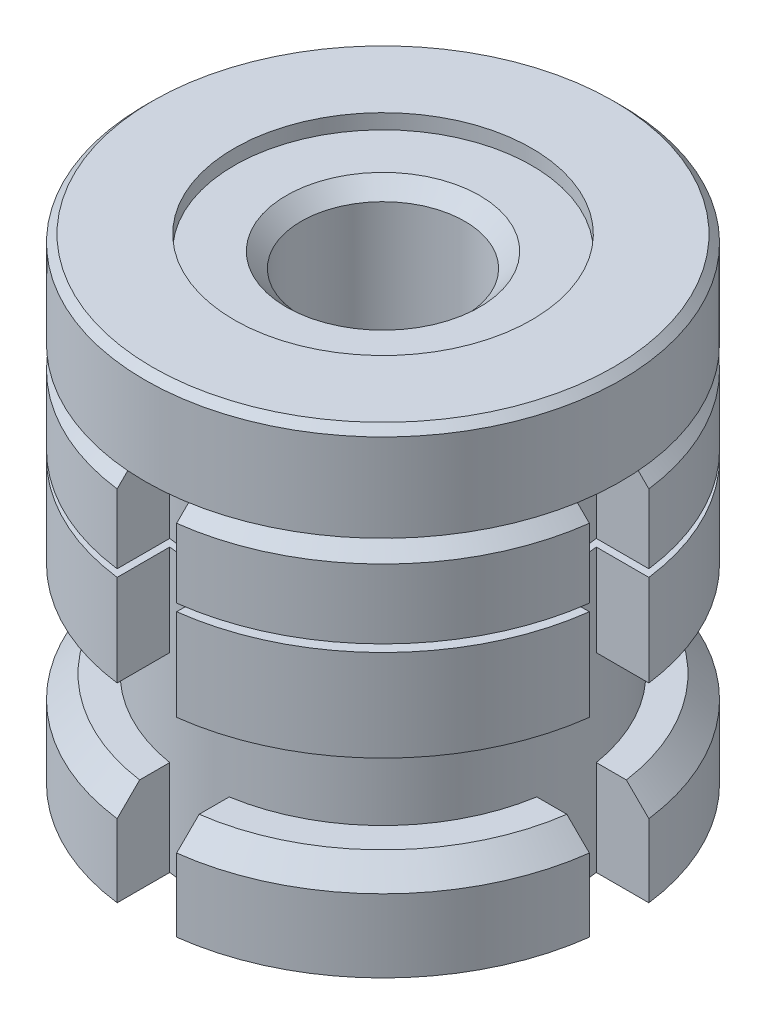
ISO-10303-21;
HEADER;
FILE_DESCRIPTION(('STEP AP214'),'2;1');
FILE_NAME('part.step','',(''),(''),'','','');
FILE_SCHEMA(('AUTOMOTIVE_DESIGN { 1 0 10303 214 1 1 1 1 }'));
ENDSEC;
DATA;
#1=APPLICATION_CONTEXT('core data for automotive mechanical design processes');
#2=APPLICATION_PROTOCOL_DEFINITION('international standard','automotive_design',2000,#1);
#3=PRODUCT_CONTEXT('',#1,'mechanical');
#4=PRODUCT('Part','Part','',(#3));
#5=PRODUCT_RELATED_PRODUCT_CATEGORY('part','',(#4));
#6=PRODUCT_DEFINITION_FORMATION('','',#4);
#7=PRODUCT_DEFINITION_CONTEXT('part definition',#1,'design');
#8=PRODUCT_DEFINITION('design','',#6,#7);
#9=PRODUCT_DEFINITION_SHAPE('','',#8);
#10=(LENGTH_UNIT() NAMED_UNIT(*) SI_UNIT(.MILLI.,.METRE.));
#11=(NAMED_UNIT(*) PLANE_ANGLE_UNIT() SI_UNIT($,.RADIAN.));
#12=(NAMED_UNIT(*) SI_UNIT($,.STERADIAN.) SOLID_ANGLE_UNIT());
#13=UNCERTAINTY_MEASURE_WITH_UNIT(LENGTH_MEASURE(1.E-05),#10,'distance_accuracy_value','');
#14=(GEOMETRIC_REPRESENTATION_CONTEXT(3) GLOBAL_UNCERTAINTY_ASSIGNED_CONTEXT((#13)) GLOBAL_UNIT_ASSIGNED_CONTEXT((#10,
#11,#12)) REPRESENTATION_CONTEXT('',''));
#15=CARTESIAN_POINT('',(0.,0.,0.));
#16=DIRECTION('',(0.,0.,1.));
#17=DIRECTION('',(1.,0.,0.));
#18=AXIS2_PLACEMENT_3D('',#15,#16,#17);
#19=CARTESIAN_POINT('',(0.,12.8,0.));
#20=DIRECTION('',(0.,-1.,0.));
#21=DIRECTION('',(0.,0.,-1.));
#22=AXIS2_PLACEMENT_3D('',#19,#20,#21);
#23=CYLINDRICAL_SURFACE('',#22,16.);
#24=DIRECTION('',(0.,1.,0.));
#25=VECTOR('',#24,1.);
#26=CARTESIAN_POINT('',(-2.00000000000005,-18.2224712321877,15.8745078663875));
#27=LINE('',#26,#25);
#28=CARTESIAN_POINT('',(-2.00000000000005,6.65,15.8745078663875));
#29=VERTEX_POINT('',#28);
#30=CARTESIAN_POINT('',(-2.00000000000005,11.3,15.8745078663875));
#31=VERTEX_POINT('',#30);
#32=EDGE_CURVE('E1110',#29,#31,#27,.T.);
#33=ORIENTED_EDGE('',*,*,#32,.T.);
#34=CARTESIAN_POINT('',(0.,11.3,0.));
#35=DIRECTION('',(0.,1.,0.));
#36=DIRECTION('',(0.,0.,1.));
#37=AXIS2_PLACEMENT_3D('',#34,#35,#36);
#38=CIRCLE('',#37,16.);
#39=CARTESIAN_POINT('',(-15.8745078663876,11.3,1.99999999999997));
#40=VERTEX_POINT('',#39);
#41=EDGE_CURVE('E55',#31,#40,#38,.F.);
#42=ORIENTED_EDGE('',*,*,#41,.T.);
#43=DIRECTION('',(0.,1.,0.));
#44=VECTOR('',#43,1.);
#45=CARTESIAN_POINT('',(-15.8745078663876,-18.2224712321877,1.99999999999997));
#46=LINE('',#45,#44);
#47=CARTESIAN_POINT('',(-15.8745078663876,6.65,1.99999999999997));
#48=VERTEX_POINT('',#47);
#49=EDGE_CURVE('E871',#48,#40,#46,.T.);
#50=ORIENTED_EDGE('',*,*,#49,.F.);
#51=CARTESIAN_POINT('',(0.,6.65,0.));
#52=DIRECTION('',(0.,1.,0.));
#53=DIRECTION('',(0.,0.,1.));
#54=AXIS2_PLACEMENT_3D('',#51,#52,#53);
#55=CIRCLE('',#54,16.);
#56=EDGE_CURVE('E589',#48,#29,#55,.T.);
#57=ORIENTED_EDGE('',*,*,#56,.T.);
#58=EDGE_LOOP('',(#33,#42,#50,#57));
#59=FACE_BOUND('',#58,.T.);
#60=ADVANCED_FACE('F39',(#59),#23,.T.);
#61=DIRECTION('',(0.,1.,0.));
#62=VECTOR('',#61,1.);
#63=CARTESIAN_POINT('',(-15.8745078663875,-18.2224712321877,-2.00000000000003));
#64=LINE('',#63,#62);
#65=CARTESIAN_POINT('',(-15.8745078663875,6.65,-2.00000000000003));
#66=VERTEX_POINT('',#65);
#67=CARTESIAN_POINT('',(-15.8745078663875,11.3,-2.00000000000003));
#68=VERTEX_POINT('',#67);
#69=EDGE_CURVE('E889',#66,#68,#64,.T.);
#70=ORIENTED_EDGE('',*,*,#69,.T.);
#71=CARTESIAN_POINT('',(0.,11.3,0.));
#72=DIRECTION('',(0.,1.,0.));
#73=DIRECTION('',(0.,0.,1.));
#74=AXIS2_PLACEMENT_3D('',#71,#72,#73);
#75=CIRCLE('',#74,16.);
#76=CARTESIAN_POINT('',(-2.00000000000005,11.3,-15.8745078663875));
#77=VERTEX_POINT('',#76);
#78=EDGE_CURVE('E647',#68,#77,#75,.F.);
#79=ORIENTED_EDGE('',*,*,#78,.T.);
#80=DIRECTION('',(0.,1.,0.));
#81=VECTOR('',#80,1.);
#82=CARTESIAN_POINT('',(-2.00000000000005,-18.2224712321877,-15.8745078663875));
#83=LINE('',#82,#81);
#84=CARTESIAN_POINT('',(-2.00000000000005,6.65,-15.8745078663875));
#85=VERTEX_POINT('',#84);
#86=EDGE_CURVE('E463',#85,#77,#83,.T.);
#87=ORIENTED_EDGE('',*,*,#86,.F.);
#88=EDGE_CURVE('E1228',#85,#66,#55,.T.);
#89=ORIENTED_EDGE('',*,*,#88,.T.);
#90=EDGE_LOOP('',(#70,#79,#87,#89));
#91=FACE_BOUND('',#90,.T.);
#92=ADVANCED_FACE('F1241',(#91),#23,.T.);
#93=DIRECTION('',(0.,1.,0.));
#94=VECTOR('',#93,1.);
#95=CARTESIAN_POINT('',(15.8745078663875,-18.2224712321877,2.00000000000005));
#96=LINE('',#95,#94);
#97=CARTESIAN_POINT('',(15.8745078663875,6.65,2.00000000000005));
#98=VERTEX_POINT('',#97);
#99=CARTESIAN_POINT('',(15.8745078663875,11.3,2.00000000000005));
#100=VERTEX_POINT('',#99);
#101=EDGE_CURVE('E1020',#98,#100,#96,.T.);
#102=ORIENTED_EDGE('',*,*,#101,.T.);
#103=CARTESIAN_POINT('',(0.,11.3,0.));
#104=DIRECTION('',(0.,1.,0.));
#105=DIRECTION('',(0.,0.,1.));
#106=AXIS2_PLACEMENT_3D('',#103,#104,#105);
#107=CIRCLE('',#106,16.);
#108=CARTESIAN_POINT('',(2.00000000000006,11.3,15.8745078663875));
#109=VERTEX_POINT('',#108);
#110=EDGE_CURVE('E730',#100,#109,#107,.F.);
#111=ORIENTED_EDGE('',*,*,#110,.T.);
#112=DIRECTION('',(0.,1.,0.));
#113=VECTOR('',#112,1.);
#114=CARTESIAN_POINT('',(2.00000000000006,-18.2224712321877,15.8745078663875));
#115=LINE('',#114,#113);
#116=CARTESIAN_POINT('',(2.00000000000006,6.65,15.8745078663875));
#117=VERTEX_POINT('',#116);
#118=EDGE_CURVE('E1102',#117,#109,#115,.T.);
#119=ORIENTED_EDGE('',*,*,#118,.F.);
#120=EDGE_CURVE('E590',#117,#98,#55,.T.);
#121=ORIENTED_EDGE('',*,*,#120,.T.);
#122=EDGE_LOOP('',(#102,#111,#119,#121));
#123=FACE_BOUND('',#122,.T.);
#124=ADVANCED_FACE('F1100',(#123),#23,.T.);
#125=CARTESIAN_POINT('',(0.,6.65,16.));
#126=DIRECTION('',(0.,1.,0.));
#127=DIRECTION('',(0.,0.,1.));
#128=AXIS2_PLACEMENT_3D('',#125,#126,#127);
#129=PLANE('',#128);
#130=CARTESIAN_POINT('',(0.,6.65,0.));
#131=DIRECTION('',(0.,1.,0.));
#132=DIRECTION('',(0.,0.,1.));
#133=AXIS2_PLACEMENT_3D('',#130,#131,#132);
#134=CIRCLE('',#133,10.);
#135=CARTESIAN_POINT('',(0.,6.65,10.));
#136=VERTEX_POINT('',#135);
#137=EDGE_CURVE('E594',#136,#136,#134,.T.);
#138=ORIENTED_EDGE('',*,*,#137,.T.);
#139=EDGE_LOOP('',(#138));
#140=FACE_BOUND('',#139,.T.);
#141=ORIENTED_EDGE('',*,*,#56,.F.);
#142=DIRECTION('',(1.,0.,0.));
#143=VECTOR('',#142,1.);
#144=CARTESIAN_POINT('',(0.,6.65,1.99999999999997));
#145=LINE('',#144,#143);
#146=CARTESIAN_POINT('',(-12.3389626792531,6.65,1.99999999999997));
#147=VERTEX_POINT('',#146);
#148=EDGE_CURVE('E564',#48,#147,#145,.T.);
#149=ORIENTED_EDGE('',*,*,#148,.T.);
#150=CARTESIAN_POINT('',(0.,6.65,0.));
#151=DIRECTION('',(0.,1.,0.));
#152=DIRECTION('',(0.,0.,1.));
#153=AXIS2_PLACEMENT_3D('',#150,#151,#152);
#154=CIRCLE('',#153,12.5);
#155=CARTESIAN_POINT('',(-12.3389626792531,6.65,-2.00000000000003));
#156=VERTEX_POINT('',#155);
#157=EDGE_CURVE('E548',#147,#156,#154,.F.);
#158=ORIENTED_EDGE('',*,*,#157,.T.);
#159=DIRECTION('',(-1.,0.,0.));
#160=VECTOR('',#159,1.);
#161=CARTESIAN_POINT('',(0.,6.65,-2.00000000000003));
#162=LINE('',#161,#160);
#163=EDGE_CURVE('E541',#156,#66,#162,.T.);
#164=ORIENTED_EDGE('',*,*,#163,.T.);
#165=ORIENTED_EDGE('',*,*,#88,.F.);
#166=DIRECTION('',(0.,0.,1.));
#167=VECTOR('',#166,1.);
#168=CARTESIAN_POINT('',(-2.00000000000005,6.65,16.));
#169=LINE('',#168,#167);
#170=CARTESIAN_POINT('',(-2.00000000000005,6.65,-12.3389626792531));
#171=VERTEX_POINT('',#170);
#172=EDGE_CURVE('E527',#85,#171,#169,.T.);
#173=ORIENTED_EDGE('',*,*,#172,.T.);
#174=CARTESIAN_POINT('',(0.,6.65,0.));
#175=DIRECTION('',(0.,1.,0.));
#176=DIRECTION('',(0.,0.,1.));
#177=AXIS2_PLACEMENT_3D('',#174,#175,#176);
#178=CIRCLE('',#177,12.5);
#179=CARTESIAN_POINT('',(2.00000000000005,6.65,-12.3389626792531));
#180=VERTEX_POINT('',#179);
#181=EDGE_CURVE('E422',#171,#180,#178,.F.);
#182=ORIENTED_EDGE('',*,*,#181,.T.);
#183=DIRECTION('',(0.,0.,-1.));
#184=VECTOR('',#183,1.);
#185=CARTESIAN_POINT('',(2.00000000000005,6.65,16.));
#186=LINE('',#185,#184);
#187=CARTESIAN_POINT('',(2.00000000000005,6.65,-15.8745078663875));
#188=VERTEX_POINT('',#187);
#189=EDGE_CURVE('E501',#180,#188,#186,.T.);
#190=ORIENTED_EDGE('',*,*,#189,.T.);
#191=CARTESIAN_POINT('',(15.8745078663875,6.65,-2.00000000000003));
#192=VERTEX_POINT('',#191);
#193=EDGE_CURVE('E595',#192,#188,#55,.T.);
#194=ORIENTED_EDGE('',*,*,#193,.F.);
#195=DIRECTION('',(-1.,0.,0.));
#196=VECTOR('',#195,1.);
#197=CARTESIAN_POINT('',(0.,6.65,-2.00000000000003));
#198=LINE('',#197,#196);
#199=CARTESIAN_POINT('',(12.3389626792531,6.65,-2.00000000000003));
#200=VERTEX_POINT('',#199);
#201=EDGE_CURVE('E1067',#192,#200,#198,.T.);
#202=ORIENTED_EDGE('',*,*,#201,.T.);
#203=CARTESIAN_POINT('',(0.,6.65,0.));
#204=DIRECTION('',(0.,1.,0.));
#205=DIRECTION('',(0.,0.,1.));
#206=AXIS2_PLACEMENT_3D('',#203,#204,#205);
#207=CIRCLE('',#206,12.5);
#208=CARTESIAN_POINT('',(12.3389626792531,6.65,2.00000000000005));
#209=VERTEX_POINT('',#208);
#210=EDGE_CURVE('E1065',#200,#209,#207,.F.);
#211=ORIENTED_EDGE('',*,*,#210,.T.);
#212=DIRECTION('',(1.,0.,0.));
#213=VECTOR('',#212,1.);
#214=CARTESIAN_POINT('',(0.,6.65,2.00000000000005));
#215=LINE('',#214,#213);
#216=EDGE_CURVE('E990',#209,#98,#215,.T.);
#217=ORIENTED_EDGE('',*,*,#216,.T.);
#218=ORIENTED_EDGE('',*,*,#120,.F.);
#219=DIRECTION('',(0.,0.,-1.));
#220=VECTOR('',#219,1.);
#221=CARTESIAN_POINT('',(2.00000000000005,6.65,16.));
#222=LINE('',#221,#220);
#223=CARTESIAN_POINT('',(2.00000000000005,6.65,12.3389626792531));
#224=VERTEX_POINT('',#223);
#225=EDGE_CURVE('E852',#117,#224,#222,.T.);
#226=ORIENTED_EDGE('',*,*,#225,.T.);
#227=CARTESIAN_POINT('',(0.,6.65,0.));
#228=DIRECTION('',(0.,1.,0.));
#229=DIRECTION('',(0.,0.,1.));
#230=AXIS2_PLACEMENT_3D('',#227,#228,#229);
#231=CIRCLE('',#230,12.5);
#232=CARTESIAN_POINT('',(-2.00000000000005,6.65,12.3389626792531));
#233=VERTEX_POINT('',#232);
#234=EDGE_CURVE('E875',#224,#233,#231,.F.);
#235=ORIENTED_EDGE('',*,*,#234,.T.);
#236=DIRECTION('',(0.,0.,1.));
#237=VECTOR('',#236,1.);
#238=CARTESIAN_POINT('',(-2.00000000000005,6.65,16.));
#239=LINE('',#238,#237);
#240=EDGE_CURVE('E1154',#233,#29,#239,.T.);
#241=ORIENTED_EDGE('',*,*,#240,.T.);
#242=EDGE_LOOP('',(#141,#149,#158,#164,#165,#173,#182,#190,#194,#202,#211,#217,#218,#226,#235,#241));
#243=FACE_BOUND('',#242,.T.);
#244=ADVANCED_FACE('F1071',(#140,#243),#129,.F.);
#245=CARTESIAN_POINT('',(0.,6.15,16.));
#246=DIRECTION('',(0.,-1.,0.));
#247=DIRECTION('',(0.,0.,-1.));
#248=AXIS2_PLACEMENT_3D('',#245,#246,#247);
#249=PLANE('',#248);
#250=CARTESIAN_POINT('',(0.,6.15,0.));
#251=DIRECTION('',(0.,1.,0.));
#252=DIRECTION('',(0.,0.,1.));
#253=AXIS2_PLACEMENT_3D('',#250,#251,#252);
#254=CIRCLE('',#253,10.);
#255=CARTESIAN_POINT('',(0.,6.15,10.));
#256=VERTEX_POINT('',#255);
#257=EDGE_CURVE('E573',#256,#256,#254,.T.);
#258=ORIENTED_EDGE('',*,*,#257,.F.);
#259=EDGE_LOOP('',(#258));
#260=FACE_BOUND('',#259,.T.);
#261=CARTESIAN_POINT('',(0.,6.15,0.));
#262=DIRECTION('',(0.,-1.,0.));
#263=DIRECTION('',(0.,0.,-1.));
#264=AXIS2_PLACEMENT_3D('',#261,#262,#263);
#265=CIRCLE('',#264,12.5);
#266=CARTESIAN_POINT('',(-12.3389626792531,6.15,-2.00000000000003));
#267=VERTEX_POINT('',#266);
#268=CARTESIAN_POINT('',(-12.3389626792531,6.15,1.99999999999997));
#269=VERTEX_POINT('',#268);
#270=EDGE_CURVE('E545',#267,#269,#265,.F.);
#271=ORIENTED_EDGE('',*,*,#270,.T.);
#272=DIRECTION('',(-1.,0.,0.));
#273=VECTOR('',#272,1.);
#274=CARTESIAN_POINT('',(0.,6.15,1.99999999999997));
#275=LINE('',#274,#273);
#276=CARTESIAN_POINT('',(-15.8745078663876,6.15,1.99999999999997));
#277=VERTEX_POINT('',#276);
#278=EDGE_CURVE('E560',#269,#277,#275,.T.);
#279=ORIENTED_EDGE('',*,*,#278,.T.);
#280=CARTESIAN_POINT('',(0.,6.15,0.));
#281=DIRECTION('',(0.,1.,0.));
#282=DIRECTION('',(0.,0.,1.));
#283=AXIS2_PLACEMENT_3D('',#280,#281,#282);
#284=CIRCLE('',#283,16.);
#285=CARTESIAN_POINT('',(-2.00000000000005,6.15,15.8745078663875));
#286=VERTEX_POINT('',#285);
#287=EDGE_CURVE('E584',#277,#286,#284,.T.);
#288=ORIENTED_EDGE('',*,*,#287,.T.);
#289=DIRECTION('',(0.,0.,-1.));
#290=VECTOR('',#289,1.);
#291=CARTESIAN_POINT('',(-2.00000000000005,6.15,16.));
#292=LINE('',#291,#290);
#293=CARTESIAN_POINT('',(-2.00000000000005,6.15,12.3389626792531));
#294=VERTEX_POINT('',#293);
#295=EDGE_CURVE('E1149',#286,#294,#292,.T.);
#296=ORIENTED_EDGE('',*,*,#295,.T.);
#297=CARTESIAN_POINT('',(0.,6.15,0.));
#298=DIRECTION('',(0.,-1.,0.));
#299=DIRECTION('',(0.,0.,-1.));
#300=AXIS2_PLACEMENT_3D('',#297,#298,#299);
#301=CIRCLE('',#300,12.5);
#302=CARTESIAN_POINT('',(2.00000000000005,6.15,12.3389626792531));
#303=VERTEX_POINT('',#302);
#304=EDGE_CURVE('E868',#294,#303,#301,.F.);
#305=ORIENTED_EDGE('',*,*,#304,.T.);
#306=DIRECTION('',(0.,0.,1.));
#307=VECTOR('',#306,1.);
#308=CARTESIAN_POINT('',(2.00000000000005,6.15,16.));
#309=LINE('',#308,#307);
#310=CARTESIAN_POINT('',(2.00000000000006,6.15,15.8745078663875));
#311=VERTEX_POINT('',#310);
#312=EDGE_CURVE('E1146',#303,#311,#309,.T.);
#313=ORIENTED_EDGE('',*,*,#312,.T.);
#314=CARTESIAN_POINT('',(15.8745078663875,6.15,2.00000000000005));
#315=VERTEX_POINT('',#314);
#316=EDGE_CURVE('E585',#311,#315,#284,.T.);
#317=ORIENTED_EDGE('',*,*,#316,.T.);
#318=DIRECTION('',(-1.,0.,0.));
#319=VECTOR('',#318,1.);
#320=CARTESIAN_POINT('',(0.,6.15,2.00000000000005));
#321=LINE('',#320,#319);
#322=CARTESIAN_POINT('',(12.3389626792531,6.15,2.00000000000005));
#323=VERTEX_POINT('',#322);
#324=EDGE_CURVE('E1089',#315,#323,#321,.T.);
#325=ORIENTED_EDGE('',*,*,#324,.T.);
#326=CARTESIAN_POINT('',(0.,6.15,0.));
#327=DIRECTION('',(0.,-1.,0.));
#328=DIRECTION('',(0.,0.,-1.));
#329=AXIS2_PLACEMENT_3D('',#326,#327,#328);
#330=CIRCLE('',#329,12.5);
#331=CARTESIAN_POINT('',(12.3389626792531,6.15,-2.00000000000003));
#332=VERTEX_POINT('',#331);
#333=EDGE_CURVE('E1159',#323,#332,#330,.F.);
#334=ORIENTED_EDGE('',*,*,#333,.T.);
#335=DIRECTION('',(1.,0.,0.));
#336=VECTOR('',#335,1.);
#337=CARTESIAN_POINT('',(0.,6.15,-2.00000000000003));
#338=LINE('',#337,#336);
#339=CARTESIAN_POINT('',(15.8745078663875,6.15,-2.00000000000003));
#340=VERTEX_POINT('',#339);
#341=EDGE_CURVE('E1076',#332,#340,#338,.T.);
#342=ORIENTED_EDGE('',*,*,#341,.T.);
#343=CARTESIAN_POINT('',(2.00000000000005,6.15,-15.8745078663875));
#344=VERTEX_POINT('',#343);
#345=EDGE_CURVE('E499',#340,#344,#284,.T.);
#346=ORIENTED_EDGE('',*,*,#345,.T.);
#347=DIRECTION('',(0.,0.,1.));
#348=VECTOR('',#347,1.);
#349=CARTESIAN_POINT('',(2.00000000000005,6.15,16.));
#350=LINE('',#349,#348);
#351=CARTESIAN_POINT('',(2.00000000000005,6.15,-12.3389626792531));
#352=VERTEX_POINT('',#351);
#353=EDGE_CURVE('E483',#344,#352,#350,.T.);
#354=ORIENTED_EDGE('',*,*,#353,.T.);
#355=CARTESIAN_POINT('',(0.,6.15,0.));
#356=DIRECTION('',(0.,-1.,0.));
#357=DIRECTION('',(0.,0.,-1.));
#358=AXIS2_PLACEMENT_3D('',#355,#356,#357);
#359=CIRCLE('',#358,12.5);
#360=CARTESIAN_POINT('',(-2.00000000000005,6.15,-12.3389626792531));
#361=VERTEX_POINT('',#360);
#362=EDGE_CURVE('E496',#352,#361,#359,.F.);
#363=ORIENTED_EDGE('',*,*,#362,.T.);
#364=DIRECTION('',(0.,0.,-1.));
#365=VECTOR('',#364,1.);
#366=CARTESIAN_POINT('',(-2.00000000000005,6.15,16.));
#367=LINE('',#366,#365);
#368=CARTESIAN_POINT('',(-2.00000000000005,6.15,-15.8745078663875));
#369=VERTEX_POINT('',#368);
#370=EDGE_CURVE('E524',#361,#369,#367,.T.);
#371=ORIENTED_EDGE('',*,*,#370,.T.);
#372=CARTESIAN_POINT('',(-15.8745078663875,6.15,-2.00000000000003));
#373=VERTEX_POINT('',#372);
#374=EDGE_CURVE('E1304',#369,#373,#284,.T.);
#375=ORIENTED_EDGE('',*,*,#374,.T.);
#376=DIRECTION('',(1.,0.,0.));
#377=VECTOR('',#376,1.);
#378=CARTESIAN_POINT('',(0.,6.15,-2.00000000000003));
#379=LINE('',#378,#377);
#380=EDGE_CURVE('E537',#373,#267,#379,.T.);
#381=ORIENTED_EDGE('',*,*,#380,.T.);
#382=EDGE_LOOP('',(#271,#279,#288,#296,#305,#313,#317,#325,#334,#342,#346,#354,#363,#371,#375,#381));
#383=FACE_BOUND('',#382,.T.);
#384=ADVANCED_FACE('F494',(#260,#383),#249,.F.);
#385=CARTESIAN_POINT('',(0.,0.,0.));
#386=DIRECTION('',(0.,1.,0.));
#387=DIRECTION('',(0.,0.,1.));
#388=AXIS2_PLACEMENT_3D('',#385,#386,#387);
#389=PLANE('',#388);
#390=CARTESIAN_POINT('',(0.,0.,0.));
#391=DIRECTION('',(0.,1.,0.));
#392=DIRECTION('',(0.,0.,1.));
#393=AXIS2_PLACEMENT_3D('',#390,#391,#392);
#394=CIRCLE('',#393,16.);
#395=CARTESIAN_POINT('',(-15.8745078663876,0.,1.99999999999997));
#396=VERTEX_POINT('',#395);
#397=CARTESIAN_POINT('',(-2.00000000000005,0.,15.8745078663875));
#398=VERTEX_POINT('',#397);
#399=EDGE_CURVE('E599',#396,#398,#394,.T.);
#400=ORIENTED_EDGE('',*,*,#399,.F.);
#401=DIRECTION('',(1.,0.,0.));
#402=VECTOR('',#401,1.);
#403=CARTESIAN_POINT('',(0.,0.,1.99999999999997));
#404=LINE('',#403,#402);
#405=CARTESIAN_POINT('',(-12.3389626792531,0.,1.99999999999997));
#406=VERTEX_POINT('',#405);
#407=EDGE_CURVE('E556',#396,#406,#404,.T.);
#408=ORIENTED_EDGE('',*,*,#407,.T.);
#409=CARTESIAN_POINT('',(0.,0.,0.));
#410=DIRECTION('',(0.,-1.,0.));
#411=DIRECTION('',(0.,0.,-1.));
#412=AXIS2_PLACEMENT_3D('',#409,#410,#411);
#413=CIRCLE('',#412,12.5);
#414=CARTESIAN_POINT('',(-2.00000000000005,0.,12.3389626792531));
#415=VERTEX_POINT('',#414);
#416=EDGE_CURVE('E1293',#415,#406,#413,.T.);
#417=ORIENTED_EDGE('',*,*,#416,.F.);
#418=DIRECTION('',(0.,0.,1.));
#419=VECTOR('',#418,1.);
#420=CARTESIAN_POINT('',(-2.00000000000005,0.,0.));
#421=LINE('',#420,#419);
#422=EDGE_CURVE('E851',#415,#398,#421,.T.);
#423=ORIENTED_EDGE('',*,*,#422,.T.);
#424=EDGE_LOOP('',(#400,#408,#417,#423));
#425=FACE_BOUND('',#424,.T.);
#426=ADVANCED_FACE('F1256',(#425),#389,.F.);
#427=CARTESIAN_POINT('',(-12.3389626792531,0.,-2.00000000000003));
#428=VERTEX_POINT('',#427);
#429=CARTESIAN_POINT('',(-2.00000000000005,0.,-12.3389626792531));
#430=VERTEX_POINT('',#429);
#431=EDGE_CURVE('E580',#428,#430,#413,.T.);
#432=ORIENTED_EDGE('',*,*,#431,.F.);
#433=DIRECTION('',(-1.,0.,0.));
#434=VECTOR('',#433,1.);
#435=CARTESIAN_POINT('',(0.,0.,-2.00000000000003));
#436=LINE('',#435,#434);
#437=CARTESIAN_POINT('',(-15.8745078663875,0.,-2.00000000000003));
#438=VERTEX_POINT('',#437);
#439=EDGE_CURVE('E533',#428,#438,#436,.T.);
#440=ORIENTED_EDGE('',*,*,#439,.T.);
#441=CARTESIAN_POINT('',(-2.00000000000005,0.,-15.8745078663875));
#442=VERTEX_POINT('',#441);
#443=EDGE_CURVE('E1282',#442,#438,#394,.T.);
#444=ORIENTED_EDGE('',*,*,#443,.F.);
#445=DIRECTION('',(0.,0.,1.));
#446=VECTOR('',#445,1.);
#447=CARTESIAN_POINT('',(-2.00000000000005,0.,0.));
#448=LINE('',#447,#446);
#449=EDGE_CURVE('E520',#442,#430,#448,.T.);
#450=ORIENTED_EDGE('',*,*,#449,.T.);
#451=EDGE_LOOP('',(#432,#440,#444,#450));
#452=FACE_BOUND('',#451,.T.);
#453=ADVANCED_FACE('F1302',(#452),#389,.F.);
#454=CARTESIAN_POINT('',(12.3389626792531,0.,2.00000000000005));
#455=VERTEX_POINT('',#454);
#456=CARTESIAN_POINT('',(2.00000000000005,0.,12.3389626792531));
#457=VERTEX_POINT('',#456);
#458=EDGE_CURVE('E579',#455,#457,#413,.T.);
#459=ORIENTED_EDGE('',*,*,#458,.F.);
#460=DIRECTION('',(1.,0.,0.));
#461=VECTOR('',#460,1.);
#462=CARTESIAN_POINT('',(0.,0.,2.00000000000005));
#463=LINE('',#462,#461);
#464=CARTESIAN_POINT('',(15.8745078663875,0.,2.00000000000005));
#465=VERTEX_POINT('',#464);
#466=EDGE_CURVE('E1079',#455,#465,#463,.T.);
#467=ORIENTED_EDGE('',*,*,#466,.T.);
#468=CARTESIAN_POINT('',(2.00000000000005,0.,15.8745078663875));
#469=VERTEX_POINT('',#468);
#470=EDGE_CURVE('E600',#469,#465,#394,.T.);
#471=ORIENTED_EDGE('',*,*,#470,.F.);
#472=DIRECTION('',(0.,0.,-1.));
#473=VECTOR('',#472,1.);
#474=CARTESIAN_POINT('',(2.00000000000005,0.,0.));
#475=LINE('',#474,#473);
#476=EDGE_CURVE('E1188',#469,#457,#475,.T.);
#477=ORIENTED_EDGE('',*,*,#476,.T.);
#478=EDGE_LOOP('',(#459,#467,#471,#477));
#479=FACE_BOUND('',#478,.T.);
#480=ADVANCED_FACE('F1187',(#479),#389,.F.);
#481=ORIENTED_EDGE('',*,*,#287,.F.);
#482=EDGE_CURVE('E869',#396,#277,#46,.T.);
#483=ORIENTED_EDGE('',*,*,#482,.F.);
#484=ORIENTED_EDGE('',*,*,#399,.T.);
#485=EDGE_CURVE('E1108',#398,#286,#27,.T.);
#486=ORIENTED_EDGE('',*,*,#485,.T.);
#487=EDGE_LOOP('',(#481,#483,#484,#486));
#488=FACE_BOUND('',#487,.T.);
#489=ADVANCED_FACE('F1273',(#488),#23,.T.);
#490=ORIENTED_EDGE('',*,*,#443,.T.);
#491=EDGE_CURVE('E887',#438,#373,#64,.T.);
#492=ORIENTED_EDGE('',*,*,#491,.T.);
#493=ORIENTED_EDGE('',*,*,#374,.F.);
#494=EDGE_CURVE('E954',#442,#369,#83,.T.);
#495=ORIENTED_EDGE('',*,*,#494,.F.);
#496=EDGE_LOOP('',(#490,#492,#493,#495));
#497=FACE_BOUND('',#496,.T.);
#498=ADVANCED_FACE('F1267',(#497),#23,.T.);
#499=ORIENTED_EDGE('',*,*,#470,.T.);
#500=EDGE_CURVE('E1019',#465,#315,#96,.T.);
#501=ORIENTED_EDGE('',*,*,#500,.T.);
#502=ORIENTED_EDGE('',*,*,#316,.F.);
#503=EDGE_CURVE('E1104',#469,#311,#115,.T.);
#504=ORIENTED_EDGE('',*,*,#503,.F.);
#505=EDGE_LOOP('',(#499,#501,#502,#504));
#506=FACE_BOUND('',#505,.T.);
#507=ADVANCED_FACE('F1183',(#506),#23,.T.);
#508=CARTESIAN_POINT('',(0.,-6.4,0.));
#509=DIRECTION('',(0.,-1.,0.));
#510=DIRECTION('',(0.,0.,-1.));
#511=AXIS2_PLACEMENT_3D('',#508,#509,#510);
#512=CYLINDRICAL_SURFACE('',#511,16.);
#513=CARTESIAN_POINT('',(-2.00000000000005,-12.8,15.8745078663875));
#514=VERTEX_POINT('',#513);
#515=CARTESIAN_POINT('',(-2.00000000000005,-7.9,15.8745078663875));
#516=VERTEX_POINT('',#515);
#517=EDGE_CURVE('E862',#514,#516,#27,.T.);
#518=ORIENTED_EDGE('',*,*,#517,.T.);
#519=CARTESIAN_POINT('',(0.,-7.9,0.));
#520=DIRECTION('',(0.,-1.,0.));
#521=DIRECTION('',(0.,0.,-1.));
#522=AXIS2_PLACEMENT_3D('',#519,#520,#521);
#523=CIRCLE('',#522,16.);
#524=CARTESIAN_POINT('',(-15.8745078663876,-7.9,1.99999999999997));
#525=VERTEX_POINT('',#524);
#526=EDGE_CURVE('E778',#516,#525,#523,.T.);
#527=ORIENTED_EDGE('',*,*,#526,.T.);
#528=CARTESIAN_POINT('',(-15.8745078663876,-12.8,1.99999999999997));
#529=VERTEX_POINT('',#528);
#530=EDGE_CURVE('E860',#529,#525,#46,.T.);
#531=ORIENTED_EDGE('',*,*,#530,.F.);
#532=CARTESIAN_POINT('',(0.,-12.8,0.));
#533=DIRECTION('',(0.,-1.,0.));
#534=DIRECTION('',(0.,0.,-1.));
#535=AXIS2_PLACEMENT_3D('',#532,#533,#534);
#536=CIRCLE('',#535,16.);
#537=EDGE_CURVE('E1930',#514,#529,#536,.T.);
#538=ORIENTED_EDGE('',*,*,#537,.F.);
#539=EDGE_LOOP('',(#518,#527,#531,#538));
#540=FACE_BOUND('',#539,.T.);
#541=ADVANCED_FACE('F858',(#540),#512,.T.);
#542=CARTESIAN_POINT('',(-15.8745078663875,-12.8,-2.00000000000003));
#543=VERTEX_POINT('',#542);
#544=CARTESIAN_POINT('',(-15.8745078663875,-7.9,-2.00000000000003));
#545=VERTEX_POINT('',#544);
#546=EDGE_CURVE('E881',#543,#545,#64,.T.);
#547=ORIENTED_EDGE('',*,*,#546,.T.);
#548=CARTESIAN_POINT('',(0.,-7.9,0.));
#549=DIRECTION('',(0.,-1.,0.));
#550=DIRECTION('',(0.,0.,-1.));
#551=AXIS2_PLACEMENT_3D('',#548,#549,#550);
#552=CIRCLE('',#551,16.);
#553=CARTESIAN_POINT('',(-2.00000000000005,-7.9,-15.8745078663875));
#554=VERTEX_POINT('',#553);
#555=EDGE_CURVE('E609',#545,#554,#552,.T.);
#556=ORIENTED_EDGE('',*,*,#555,.T.);
#557=CARTESIAN_POINT('',(-2.00000000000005,-12.8,-15.8745078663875));
#558=VERTEX_POINT('',#557);
#559=EDGE_CURVE('E951',#558,#554,#83,.T.);
#560=ORIENTED_EDGE('',*,*,#559,.F.);
#561=EDGE_CURVE('E568',#543,#558,#536,.T.);
#562=ORIENTED_EDGE('',*,*,#561,.F.);
#563=EDGE_LOOP('',(#547,#556,#560,#562));
#564=FACE_BOUND('',#563,.T.);
#565=ADVANCED_FACE('F1272',(#564),#512,.T.);
#566=CARTESIAN_POINT('',(15.8745078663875,-12.8,2.00000000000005));
#567=VERTEX_POINT('',#566);
#568=CARTESIAN_POINT('',(15.8745078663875,-7.9,2.00000000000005));
#569=VERTEX_POINT('',#568);
#570=EDGE_CURVE('E1013',#567,#569,#96,.T.);
#571=ORIENTED_EDGE('',*,*,#570,.T.);
#572=CARTESIAN_POINT('',(0.,-7.9,0.));
#573=DIRECTION('',(0.,-1.,0.));
#574=DIRECTION('',(0.,0.,-1.));
#575=AXIS2_PLACEMENT_3D('',#572,#573,#574);
#576=CIRCLE('',#575,16.);
#577=CARTESIAN_POINT('',(2.00000000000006,-7.9,15.8745078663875));
#578=VERTEX_POINT('',#577);
#579=EDGE_CURVE('E749',#569,#578,#576,.T.);
#580=ORIENTED_EDGE('',*,*,#579,.T.);
#581=CARTESIAN_POINT('',(2.00000000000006,-12.8,15.8745078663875));
#582=VERTEX_POINT('',#581);
#583=EDGE_CURVE('E1106',#582,#578,#115,.T.);
#584=ORIENTED_EDGE('',*,*,#583,.F.);
#585=EDGE_CURVE('E574',#567,#582,#536,.T.);
#586=ORIENTED_EDGE('',*,*,#585,.F.);
#587=EDGE_LOOP('',(#571,#580,#584,#586));
#588=FACE_BOUND('',#587,.T.);
#589=ADVANCED_FACE('F1254',(#588),#512,.T.);
#590=CARTESIAN_POINT('',(0.,-6.4,0.));
#591=DIRECTION('',(0.,-1.,0.));
#592=DIRECTION('',(0.,0.,-1.));
#593=AXIS2_PLACEMENT_3D('',#590,#591,#592);
#594=PLANE('',#593);
#595=DIRECTION('',(-1.,0.,0.));
#596=VECTOR('',#595,1.);
#597=CARTESIAN_POINT('',(0.,-6.4,1.99999999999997));
#598=LINE('',#597,#596);
#599=CARTESIAN_POINT('',(-12.3389626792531,-6.4,1.99999999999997));
#600=VERTEX_POINT('',#599);
#601=CARTESIAN_POINT('',(-14.3614066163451,-6.4,1.99999999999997));
#602=VERTEX_POINT('',#601);
#603=EDGE_CURVE('E552',#600,#602,#598,.T.);
#604=ORIENTED_EDGE('',*,*,#603,.T.);
#605=CARTESIAN_POINT('',(0.,-6.4,0.));
#606=DIRECTION('',(0.,-1.,0.));
#607=DIRECTION('',(0.,0.,-1.));
#608=AXIS2_PLACEMENT_3D('',#605,#606,#607);
#609=CIRCLE('',#608,14.5);
#610=CARTESIAN_POINT('',(-2.00000000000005,-6.4,14.3614066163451));
#611=VERTEX_POINT('',#610);
#612=EDGE_CURVE('E788',#602,#611,#609,.F.);
#613=ORIENTED_EDGE('',*,*,#612,.T.);
#614=DIRECTION('',(0.,0.,-1.));
#615=VECTOR('',#614,1.);
#616=CARTESIAN_POINT('',(-2.00000000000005,-6.4,0.));
#617=LINE('',#616,#615);
#618=CARTESIAN_POINT('',(-2.00000000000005,-6.4,12.3389626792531));
#619=VERTEX_POINT('',#618);
#620=EDGE_CURVE('E843',#611,#619,#617,.T.);
#621=ORIENTED_EDGE('',*,*,#620,.T.);
#622=CARTESIAN_POINT('',(0.,-6.4,0.));
#623=DIRECTION('',(0.,-1.,0.));
#624=DIRECTION('',(0.,0.,-1.));
#625=AXIS2_PLACEMENT_3D('',#622,#623,#624);
#626=CIRCLE('',#625,12.5);
#627=EDGE_CURVE('E1926',#619,#600,#626,.T.);
#628=ORIENTED_EDGE('',*,*,#627,.T.);
#629=EDGE_LOOP('',(#604,#613,#621,#628));
#630=FACE_BOUND('',#629,.T.);
#631=ADVANCED_FACE('F841',(#630),#594,.F.);
#632=DIRECTION('',(0.,0.,-1.));
#633=VECTOR('',#632,1.);
#634=CARTESIAN_POINT('',(-2.00000000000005,-6.4,0.));
#635=LINE('',#634,#633);
#636=CARTESIAN_POINT('',(-2.00000000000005,-6.4,-12.3389626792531));
#637=VERTEX_POINT('',#636);
#638=CARTESIAN_POINT('',(-2.00000000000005,-6.4,-14.3614066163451));
#639=VERTEX_POINT('',#638);
#640=EDGE_CURVE('E516',#637,#639,#635,.T.);
#641=ORIENTED_EDGE('',*,*,#640,.T.);
#642=CARTESIAN_POINT('',(0.,-6.4,0.));
#643=DIRECTION('',(0.,-1.,0.));
#644=DIRECTION('',(0.,0.,-1.));
#645=AXIS2_PLACEMENT_3D('',#642,#643,#644);
#646=CIRCLE('',#645,14.5);
#647=CARTESIAN_POINT('',(-14.3614066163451,-6.4,-2.00000000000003));
#648=VERTEX_POINT('',#647);
#649=EDGE_CURVE('E622',#639,#648,#646,.F.);
#650=ORIENTED_EDGE('',*,*,#649,.T.);
#651=DIRECTION('',(1.,0.,0.));
#652=VECTOR('',#651,1.);
#653=CARTESIAN_POINT('',(0.,-6.4,-2.00000000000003));
#654=LINE('',#653,#652);
#655=CARTESIAN_POINT('',(-12.3389626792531,-6.4,-2.00000000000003));
#656=VERTEX_POINT('',#655);
#657=EDGE_CURVE('E530',#648,#656,#654,.T.);
#658=ORIENTED_EDGE('',*,*,#657,.T.);
#659=EDGE_CURVE('E578',#656,#637,#626,.T.);
#660=ORIENTED_EDGE('',*,*,#659,.T.);
#661=EDGE_LOOP('',(#641,#650,#658,#660));
#662=FACE_BOUND('',#661,.T.);
#663=ADVANCED_FACE('F1779',(#662),#594,.F.);
#664=DIRECTION('',(0.,0.,1.));
#665=VECTOR('',#664,1.);
#666=CARTESIAN_POINT('',(2.00000000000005,-6.4,0.));
#667=LINE('',#666,#665);
#668=CARTESIAN_POINT('',(2.00000000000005,-6.4,12.3389626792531));
#669=VERTEX_POINT('',#668);
#670=CARTESIAN_POINT('',(2.00000000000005,-6.4,14.3614066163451));
#671=VERTEX_POINT('',#670);
#672=EDGE_CURVE('E1215',#669,#671,#667,.T.);
#673=ORIENTED_EDGE('',*,*,#672,.T.);
#674=CARTESIAN_POINT('',(0.,-6.4,0.));
#675=DIRECTION('',(0.,-1.,0.));
#676=DIRECTION('',(0.,0.,-1.));
#677=AXIS2_PLACEMENT_3D('',#674,#675,#676);
#678=CIRCLE('',#677,14.5);
#679=CARTESIAN_POINT('',(14.3614066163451,-6.4,2.00000000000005));
#680=VERTEX_POINT('',#679);
#681=EDGE_CURVE('E769',#671,#680,#678,.F.);
#682=ORIENTED_EDGE('',*,*,#681,.T.);
#683=DIRECTION('',(-1.,0.,0.));
#684=VECTOR('',#683,1.);
#685=CARTESIAN_POINT('',(0.,-6.4,2.00000000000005));
#686=LINE('',#685,#684);
#687=CARTESIAN_POINT('',(12.3389626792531,-6.4,2.00000000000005));
#688=VERTEX_POINT('',#687);
#689=EDGE_CURVE('E1075',#680,#688,#686,.T.);
#690=ORIENTED_EDGE('',*,*,#689,.T.);
#691=EDGE_CURVE('E610',#688,#669,#626,.T.);
#692=ORIENTED_EDGE('',*,*,#691,.T.);
#693=EDGE_LOOP('',(#673,#682,#690,#692));
#694=FACE_BOUND('',#693,.T.);
#695=ADVANCED_FACE('F1720',(#694),#594,.F.);
#696=CARTESIAN_POINT('',(0.,-12.8,0.));
#697=DIRECTION('',(0.,-1.,0.));
#698=DIRECTION('',(0.,0.,-1.));
#699=AXIS2_PLACEMENT_3D('',#696,#697,#698);
#700=PLANE('',#699);
#701=CARTESIAN_POINT('',(0.,-12.8,0.));
#702=DIRECTION('',(0.,-1.,0.));
#703=DIRECTION('',(0.,0.,-1.));
#704=AXIS2_PLACEMENT_3D('',#701,#702,#703);
#705=CIRCLE('',#704,6.49999999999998);
#706=CARTESIAN_POINT('',(0.,-12.8,-6.49999999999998));
#707=VERTEX_POINT('',#706);
#708=EDGE_CURVE('E1356',#707,#707,#705,.F.);
#709=ORIENTED_EDGE('',*,*,#708,.T.);
#710=EDGE_LOOP('',(#709));
#711=FACE_BOUND('',#710,.T.);
#712=DIRECTION('',(1.,0.,0.));
#713=VECTOR('',#712,1.);
#714=CARTESIAN_POINT('',(-12.3389626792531,-12.8,1.99999999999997));
#715=LINE('',#714,#713);
#716=CARTESIAN_POINT('',(-12.3389626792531,-12.8,1.99999999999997));
#717=VERTEX_POINT('',#716);
#718=EDGE_CURVE('E866',#529,#717,#715,.T.);
#719=ORIENTED_EDGE('',*,*,#718,.T.);
#720=CARTESIAN_POINT('',(0.,-12.8,0.));
#721=DIRECTION('',(0.,-1.,0.));
#722=DIRECTION('',(0.,0.,-1.));
#723=AXIS2_PLACEMENT_3D('',#720,#721,#722);
#724=CIRCLE('',#723,12.5);
#725=CARTESIAN_POINT('',(-12.3389626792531,-12.8,-2.00000000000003));
#726=VERTEX_POINT('',#725);
#727=EDGE_CURVE('E919',#717,#726,#724,.T.);
#728=ORIENTED_EDGE('',*,*,#727,.T.);
#729=DIRECTION('',(-1.,0.,0.));
#730=VECTOR('',#729,1.);
#731=CARTESIAN_POINT('',(-15.8745078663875,-12.8,-2.00000000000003));
#732=LINE('',#731,#730);
#733=EDGE_CURVE('E901',#726,#543,#732,.T.);
#734=ORIENTED_EDGE('',*,*,#733,.T.);
#735=ORIENTED_EDGE('',*,*,#561,.T.);
#736=DIRECTION('',(0.,0.,1.));
#737=VECTOR('',#736,1.);
#738=CARTESIAN_POINT('',(-2.00000000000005,-12.8,-15.8745078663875));
#739=LINE('',#738,#737);
#740=CARTESIAN_POINT('',(-2.00000000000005,-12.8,-12.3389626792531));
#741=VERTEX_POINT('',#740);
#742=EDGE_CURVE('E425',#558,#741,#739,.T.);
#743=ORIENTED_EDGE('',*,*,#742,.T.);
#744=CARTESIAN_POINT('',(0.,-12.8,0.));
#745=DIRECTION('',(0.,-1.,0.));
#746=DIRECTION('',(0.,0.,-1.));
#747=AXIS2_PLACEMENT_3D('',#744,#745,#746);
#748=CIRCLE('',#747,12.5);
#749=CARTESIAN_POINT('',(2.00000000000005,-12.8,-12.3389626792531));
#750=VERTEX_POINT('',#749);
#751=EDGE_CURVE('E439',#741,#750,#748,.T.);
#752=ORIENTED_EDGE('',*,*,#751,.T.);
#753=DIRECTION('',(0.,0.,-1.));
#754=VECTOR('',#753,1.);
#755=CARTESIAN_POINT('',(2.00000000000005,-12.8,-12.3389626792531));
#756=LINE('',#755,#754);
#757=CARTESIAN_POINT('',(2.00000000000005,-12.8,-15.8745078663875));
#758=VERTEX_POINT('',#757);
#759=EDGE_CURVE('E459',#750,#758,#756,.T.);
#760=ORIENTED_EDGE('',*,*,#759,.T.);
#761=CARTESIAN_POINT('',(15.8745078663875,-12.8,-2.00000000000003));
#762=VERTEX_POINT('',#761);
#763=EDGE_CURVE('E569',#758,#762,#536,.T.);
#764=ORIENTED_EDGE('',*,*,#763,.T.);
#765=DIRECTION('',(-1.,0.,0.));
#766=VECTOR('',#765,1.);
#767=CARTESIAN_POINT('',(12.3389626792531,-12.8,-2.00000000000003));
#768=LINE('',#767,#766);
#769=CARTESIAN_POINT('',(12.3389626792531,-12.8,-2.00000000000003));
#770=VERTEX_POINT('',#769);
#771=EDGE_CURVE('E1001',#762,#770,#768,.T.);
#772=ORIENTED_EDGE('',*,*,#771,.T.);
#773=CARTESIAN_POINT('',(0.,-12.8,0.));
#774=DIRECTION('',(0.,-1.,0.));
#775=DIRECTION('',(0.,0.,-1.));
#776=AXIS2_PLACEMENT_3D('',#773,#774,#775);
#777=CIRCLE('',#776,12.5);
#778=CARTESIAN_POINT('',(12.3389626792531,-12.8,2.00000000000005));
#779=VERTEX_POINT('',#778);
#780=EDGE_CURVE('E1048',#770,#779,#777,.T.);
#781=ORIENTED_EDGE('',*,*,#780,.T.);
#782=DIRECTION('',(1.,0.,0.));
#783=VECTOR('',#782,1.);
#784=CARTESIAN_POINT('',(15.8745078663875,-12.8,2.00000000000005));
#785=LINE('',#784,#783);
#786=EDGE_CURVE('E1030',#779,#567,#785,.T.);
#787=ORIENTED_EDGE('',*,*,#786,.T.);
#788=ORIENTED_EDGE('',*,*,#585,.T.);
#789=DIRECTION('',(0.,0.,-1.));
#790=VECTOR('',#789,1.);
#791=CARTESIAN_POINT('',(2.00000000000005,-12.8,15.8745078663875));
#792=LINE('',#791,#790);
#793=CARTESIAN_POINT('',(2.00000000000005,-12.8,12.3389626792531));
#794=VERTEX_POINT('',#793);
#795=EDGE_CURVE('E1114',#582,#794,#792,.T.);
#796=ORIENTED_EDGE('',*,*,#795,.T.);
#797=CARTESIAN_POINT('',(0.,-12.8,0.));
#798=DIRECTION('',(0.,-1.,0.));
#799=DIRECTION('',(0.,0.,-1.));
#800=AXIS2_PLACEMENT_3D('',#797,#798,#799);
#801=CIRCLE('',#800,12.5);
#802=CARTESIAN_POINT('',(-2.00000000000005,-12.8,12.3389626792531));
#803=VERTEX_POINT('',#802);
#804=EDGE_CURVE('E1126',#794,#803,#801,.T.);
#805=ORIENTED_EDGE('',*,*,#804,.T.);
#806=DIRECTION('',(0.,0.,1.));
#807=VECTOR('',#806,1.);
#808=CARTESIAN_POINT('',(-2.00000000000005,-12.8,12.3389626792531));
#809=LINE('',#808,#807);
#810=EDGE_CURVE('E1197',#803,#514,#809,.T.);
#811=ORIENTED_EDGE('',*,*,#810,.T.);
#812=ORIENTED_EDGE('',*,*,#537,.T.);
#813=EDGE_LOOP('',(#719,#728,#734,#735,#743,#752,#760,#764,#772,#781,#787,#788,#796,#805,#811,#812));
#814=FACE_BOUND('',#813,.T.);
#815=ADVANCED_FACE('F1264',(#711,#814),#700,.T.);
#816=CARTESIAN_POINT('',(0.,-12.8,0.));
#817=DIRECTION('',(0.,1.,0.));
#818=DIRECTION('',(0.,0.,1.));
#819=AXIS2_PLACEMENT_3D('',#816,#817,#818);
#820=CYLINDRICAL_SURFACE('',#819,12.5);
#821=DIRECTION('',(0.,1.,0.));
#822=VECTOR('',#821,1.);
#823=CARTESIAN_POINT('',(-12.3389626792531,-18.2224712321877,1.99999999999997));
#824=LINE('',#823,#822);
#825=EDGE_CURVE('E921',#717,#600,#824,.T.);
#826=ORIENTED_EDGE('',*,*,#825,.T.);
#827=ORIENTED_EDGE('',*,*,#627,.F.);
#828=DIRECTION('',(0.,1.,0.));
#829=VECTOR('',#828,1.);
#830=CARTESIAN_POINT('',(-2.00000000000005,-18.2224712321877,12.3389626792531));
#831=LINE('',#830,#829);
#832=EDGE_CURVE('E848',#803,#619,#831,.T.);
#833=ORIENTED_EDGE('',*,*,#832,.F.);
#834=ORIENTED_EDGE('',*,*,#804,.F.);
#835=DIRECTION('',(0.,1.,0.));
#836=VECTOR('',#835,1.);
#837=CARTESIAN_POINT('',(2.00000000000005,-18.2224712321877,12.3389626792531));
#838=LINE('',#837,#836);
#839=EDGE_CURVE('E1124',#794,#669,#838,.T.);
#840=ORIENTED_EDGE('',*,*,#839,.T.);
#841=ORIENTED_EDGE('',*,*,#691,.F.);
#842=DIRECTION('',(0.,1.,0.));
#843=VECTOR('',#842,1.);
#844=CARTESIAN_POINT('',(12.3389626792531,-18.2224712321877,2.00000000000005));
#845=LINE('',#844,#843);
#846=EDGE_CURVE('E418',#779,#688,#845,.T.);
#847=ORIENTED_EDGE('',*,*,#846,.F.);
#848=ORIENTED_EDGE('',*,*,#780,.F.);
#849=DIRECTION('',(0.,1.,0.));
#850=VECTOR('',#849,1.);
#851=CARTESIAN_POINT('',(12.3389626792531,-18.2224712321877,-2.00000000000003));
#852=LINE('',#851,#850);
#853=CARTESIAN_POINT('',(12.3389626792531,-6.4,-2.00000000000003));
#854=VERTEX_POINT('',#853);
#855=EDGE_CURVE('E1051',#770,#854,#852,.T.);
#856=ORIENTED_EDGE('',*,*,#855,.T.);
#857=CARTESIAN_POINT('',(2.00000000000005,-6.4,-12.3389626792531));
#858=VERTEX_POINT('',#857);
#859=EDGE_CURVE('E605',#858,#854,#626,.T.);
#860=ORIENTED_EDGE('',*,*,#859,.F.);
#861=DIRECTION('',(0.,1.,0.));
#862=VECTOR('',#861,1.);
#863=CARTESIAN_POINT('',(2.00000000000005,-18.2224712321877,-12.3389626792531));
#864=LINE('',#863,#862);
#865=EDGE_CURVE('E456',#750,#858,#864,.T.);
#866=ORIENTED_EDGE('',*,*,#865,.F.);
#867=ORIENTED_EDGE('',*,*,#751,.F.);
#868=DIRECTION('',(0.,1.,0.));
#869=VECTOR('',#868,1.);
#870=CARTESIAN_POINT('',(-2.00000000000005,-18.2224712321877,-12.3389626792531));
#871=LINE('',#870,#869);
#872=EDGE_CURVE('E427',#741,#637,#871,.T.);
#873=ORIENTED_EDGE('',*,*,#872,.T.);
#874=ORIENTED_EDGE('',*,*,#659,.F.);
#875=DIRECTION('',(0.,1.,0.));
#876=VECTOR('',#875,1.);
#877=CARTESIAN_POINT('',(-12.3389626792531,-18.2224712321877,-2.00000000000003));
#878=LINE('',#877,#876);
#879=EDGE_CURVE('E908',#726,#656,#878,.T.);
#880=ORIENTED_EDGE('',*,*,#879,.F.);
#881=ORIENTED_EDGE('',*,*,#727,.F.);
#882=EDGE_LOOP('',(#826,#827,#833,#834,#840,#841,#847,#848,#856,#860,#866,#867,#873,#874,#880,#881));
#883=FACE_BOUND('',#882,.T.);
#884=ORIENTED_EDGE('',*,*,#416,.T.);
#885=EDGE_CURVE('E926',#406,#269,#824,.T.);
#886=ORIENTED_EDGE('',*,*,#885,.T.);
#887=ORIENTED_EDGE('',*,*,#270,.F.);
#888=EDGE_CURVE('E915',#428,#267,#878,.T.);
#889=ORIENTED_EDGE('',*,*,#888,.F.);
#890=ORIENTED_EDGE('',*,*,#431,.T.);
#891=EDGE_CURVE('E424',#430,#361,#871,.T.);
#892=ORIENTED_EDGE('',*,*,#891,.T.);
#893=ORIENTED_EDGE('',*,*,#362,.F.);
#894=CARTESIAN_POINT('',(2.00000000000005,0.,-12.3389626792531));
#895=VERTEX_POINT('',#894);
#896=EDGE_CURVE('E455',#895,#352,#864,.T.);
#897=ORIENTED_EDGE('',*,*,#896,.F.);
#898=CARTESIAN_POINT('',(12.3389626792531,0.,-2.00000000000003));
#899=VERTEX_POINT('',#898);
#900=EDGE_CURVE('E575',#895,#899,#413,.T.);
#901=ORIENTED_EDGE('',*,*,#900,.T.);
#902=EDGE_CURVE('E1054',#899,#332,#852,.T.);
#903=ORIENTED_EDGE('',*,*,#902,.T.);
#904=ORIENTED_EDGE('',*,*,#333,.F.);
#905=EDGE_CURVE('E1181',#455,#323,#845,.T.);
#906=ORIENTED_EDGE('',*,*,#905,.F.);
#907=ORIENTED_EDGE('',*,*,#458,.T.);
#908=EDGE_CURVE('E1123',#457,#303,#838,.T.);
#909=ORIENTED_EDGE('',*,*,#908,.T.);
#910=ORIENTED_EDGE('',*,*,#304,.F.);
#911=EDGE_CURVE('E1211',#415,#294,#831,.T.);
#912=ORIENTED_EDGE('',*,*,#911,.F.);
#913=EDGE_LOOP('',(#884,#886,#887,#889,#890,#892,#893,#897,#901,#903,#904,#906,#907,#909,#910,#912));
#914=FACE_BOUND('',#913,.T.);
#915=ADVANCED_FACE('F1137',(#883,#914),#820,.T.);
#916=DIRECTION('',(0.,1.,0.));
#917=VECTOR('',#916,1.);
#918=CARTESIAN_POINT('',(2.00000000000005,-18.2224712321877,-15.8745078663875));
#919=LINE('',#918,#917);
#920=CARTESIAN_POINT('',(2.00000000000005,11.3,-15.8745078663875));
#921=VERTEX_POINT('',#920);
#922=EDGE_CURVE('E465',#188,#921,#919,.T.);
#923=ORIENTED_EDGE('',*,*,#922,.T.);
#924=CARTESIAN_POINT('',(0.,11.3,0.));
#925=DIRECTION('',(0.,1.,0.));
#926=DIRECTION('',(0.,0.,1.));
#927=AXIS2_PLACEMENT_3D('',#924,#925,#926);
#928=CIRCLE('',#927,16.);
#929=CARTESIAN_POINT('',(15.8745078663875,11.3,-2.00000000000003));
#930=VERTEX_POINT('',#929);
#931=EDGE_CURVE('E724',#921,#930,#928,.F.);
#932=ORIENTED_EDGE('',*,*,#931,.T.);
#933=DIRECTION('',(0.,1.,0.));
#934=VECTOR('',#933,1.);
#935=CARTESIAN_POINT('',(15.8745078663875,-18.2224712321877,-2.00000000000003));
#936=LINE('',#935,#934);
#937=EDGE_CURVE('E1005',#192,#930,#936,.T.);
#938=ORIENTED_EDGE('',*,*,#937,.F.);
#939=ORIENTED_EDGE('',*,*,#193,.T.);
#940=EDGE_LOOP('',(#923,#932,#938,#939));
#941=FACE_BOUND('',#940,.T.);
#942=ADVANCED_FACE('F1232',(#941),#23,.T.);
#943=CARTESIAN_POINT('',(0.,13.2647697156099,0.));
#944=DIRECTION('',(0.,1.,0.));
#945=DIRECTION('',(0.,0.,1.));
#946=AXIS2_PLACEMENT_3D('',#943,#944,#945);
#947=CYLINDRICAL_SURFACE('',#946,10.);
#948=ORIENTED_EDGE('',*,*,#137,.F.);
#949=EDGE_LOOP('',(#948));
#950=FACE_BOUND('',#949,.T.);
#951=ORIENTED_EDGE('',*,*,#257,.T.);
#952=EDGE_LOOP('',(#951));
#953=FACE_BOUND('',#952,.T.);
#954=ADVANCED_FACE('F1255',(#950,#953),#947,.T.);
#955=ORIENTED_EDGE('',*,*,#900,.F.);
#956=DIRECTION('',(0.,0.,-1.));
#957=VECTOR('',#956,1.);
#958=CARTESIAN_POINT('',(2.00000000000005,0.,0.));
#959=LINE('',#958,#957);
#960=CARTESIAN_POINT('',(2.00000000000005,0.,-15.8745078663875));
#961=VERTEX_POINT('',#960);
#962=EDGE_CURVE('E486',#895,#961,#959,.T.);
#963=ORIENTED_EDGE('',*,*,#962,.T.);
#964=CARTESIAN_POINT('',(15.8745078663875,0.,-2.00000000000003));
#965=VERTEX_POINT('',#964);
#966=EDGE_CURVE('E604',#965,#961,#394,.T.);
#967=ORIENTED_EDGE('',*,*,#966,.F.);
#968=DIRECTION('',(-1.,0.,0.));
#969=VECTOR('',#968,1.);
#970=CARTESIAN_POINT('',(0.,0.,-2.00000000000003));
#971=LINE('',#970,#969);
#972=EDGE_CURVE('E1082',#965,#899,#971,.T.);
#973=ORIENTED_EDGE('',*,*,#972,.T.);
#974=EDGE_LOOP('',(#955,#963,#967,#973));
#975=FACE_BOUND('',#974,.T.);
#976=ADVANCED_FACE('F1174',(#975),#389,.F.);
#977=ORIENTED_EDGE('',*,*,#966,.T.);
#978=EDGE_CURVE('E464',#961,#344,#919,.T.);
#979=ORIENTED_EDGE('',*,*,#978,.T.);
#980=ORIENTED_EDGE('',*,*,#345,.F.);
#981=EDGE_CURVE('E1003',#965,#340,#936,.T.);
#982=ORIENTED_EDGE('',*,*,#981,.F.);
#983=EDGE_LOOP('',(#977,#979,#980,#982));
#984=FACE_BOUND('',#983,.T.);
#985=ADVANCED_FACE('F1242',(#984),#23,.T.);
#986=CARTESIAN_POINT('',(2.00000000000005,-7.90000000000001,-15.8745078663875));
#987=VERTEX_POINT('',#986);
#988=EDGE_CURVE('E460',#758,#987,#919,.T.);
#989=ORIENTED_EDGE('',*,*,#988,.T.);
#990=CARTESIAN_POINT('',(0.,-7.90000000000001,0.));
#991=DIRECTION('',(0.,-1.,0.));
#992=DIRECTION('',(0.,0.,-1.));
#993=AXIS2_PLACEMENT_3D('',#990,#991,#992);
#994=CIRCLE('',#993,16.);
#995=CARTESIAN_POINT('',(15.8745078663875,-7.90000000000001,-2.00000000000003));
#996=VERTEX_POINT('',#995);
#997=EDGE_CURVE('E692',#987,#996,#994,.T.);
#998=ORIENTED_EDGE('',*,*,#997,.T.);
#999=EDGE_CURVE('E997',#762,#996,#936,.T.);
#1000=ORIENTED_EDGE('',*,*,#999,.F.);
#1001=ORIENTED_EDGE('',*,*,#763,.F.);
#1002=EDGE_LOOP('',(#989,#998,#1000,#1001));
#1003=FACE_BOUND('',#1002,.T.);
#1004=ADVANCED_FACE('F995',(#1003),#512,.T.);
#1005=DIRECTION('',(1.,0.,0.));
#1006=VECTOR('',#1005,1.);
#1007=CARTESIAN_POINT('',(0.,-6.4,-2.00000000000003));
#1008=LINE('',#1007,#1006);
#1009=CARTESIAN_POINT('',(14.3614066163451,-6.4,-2.00000000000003));
#1010=VERTEX_POINT('',#1009);
#1011=EDGE_CURVE('E987',#854,#1010,#1008,.T.);
#1012=ORIENTED_EDGE('',*,*,#1011,.T.);
#1013=CARTESIAN_POINT('',(0.,-6.4,0.));
#1014=DIRECTION('',(0.,-1.,0.));
#1015=DIRECTION('',(0.,0.,-1.));
#1016=AXIS2_PLACEMENT_3D('',#1013,#1014,#1015);
#1017=CIRCLE('',#1016,14.5);
#1018=CARTESIAN_POINT('',(2.00000000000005,-6.4,-14.3614066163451));
#1019=VERTEX_POINT('',#1018);
#1020=EDGE_CURVE('E702',#1010,#1019,#1017,.F.);
#1021=ORIENTED_EDGE('',*,*,#1020,.T.);
#1022=DIRECTION('',(0.,0.,1.));
#1023=VECTOR('',#1022,1.);
#1024=CARTESIAN_POINT('',(2.00000000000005,-6.4,0.));
#1025=LINE('',#1024,#1023);
#1026=EDGE_CURVE('E509',#1019,#858,#1025,.T.);
#1027=ORIENTED_EDGE('',*,*,#1026,.T.);
#1028=ORIENTED_EDGE('',*,*,#859,.T.);
#1029=EDGE_LOOP('',(#1012,#1021,#1027,#1028));
#1030=FACE_BOUND('',#1029,.T.);
#1031=ADVANCED_FACE('F986',(#1030),#594,.F.);
#1032=CARTESIAN_POINT('',(2.00000000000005,-18.2224712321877,15.8745078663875));
#1033=DIRECTION('',(1.,0.,0.));
#1034=DIRECTION('',(0.,0.,-1.));
#1035=AXIS2_PLACEMENT_3D('',#1032,#1033,#1034);
#1036=PLANE('',#1035);
#1037=ORIENTED_EDGE('',*,*,#583,.T.);
#1038=CARTESIAN_POINT('',(2.00000000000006,-7.9,15.8745078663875));
#1039=CARTESIAN_POINT('',(2.00000000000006,-7.64989120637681,15.6224321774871));
#1040=CARTESIAN_POINT('',(2.00000000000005,-7.39983680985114,15.3703025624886));
#1041=CARTESIAN_POINT('',(2.00000000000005,-6.89983680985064,14.8659354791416));
#1042=CARTESIAN_POINT('',(2.00000000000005,-6.64989120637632,14.6136980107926));
#1043=CARTESIAN_POINT('',(2.00000000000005,-6.4,14.3614066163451));
#1044=B_SPLINE_CURVE_WITH_KNOTS('',3,(#1038,#1039,#1040,#1041,#1042,#1043),.UNSPECIFIED.,.F.,
.F.,(4,2,4),(0.,1.06530225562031,2.13060451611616),.UNSPECIFIED.);
#1045=EDGE_CURVE('E763',#578,#671,#1044,.T.);
#1046=ORIENTED_EDGE('',*,*,#1045,.T.);
#1047=ORIENTED_EDGE('',*,*,#672,.F.);
#1048=ORIENTED_EDGE('',*,*,#839,.F.);
#1049=ORIENTED_EDGE('',*,*,#795,.F.);
#1050=EDGE_LOOP('',(#1037,#1046,#1047,#1048,#1049));
#1051=FACE_BOUND('',#1050,.T.);
#1052=ADVANCED_FACE('F759',(#1051),#1036,.F.);
#1053=CARTESIAN_POINT('',(-2.00000000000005,-18.2224712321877,12.3389626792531));
#1054=DIRECTION('',(-1.,0.,0.));
#1055=DIRECTION('',(0.,0.,1.));
#1056=AXIS2_PLACEMENT_3D('',#1053,#1054,#1055);
#1057=PLANE('',#1056);
#1058=ORIENTED_EDGE('',*,*,#620,.F.);
#1059=CARTESIAN_POINT('',(-2.00000000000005,-6.4,14.3614066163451));
#1060=CARTESIAN_POINT('',(-2.00000000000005,-6.64989120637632,14.6136980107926));
#1061=CARTESIAN_POINT('',(-2.00000000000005,-6.89983680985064,14.8659354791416));
#1062=CARTESIAN_POINT('',(-2.00000000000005,-7.39983680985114,15.3703025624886));
#1063=CARTESIAN_POINT('',(-2.00000000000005,-7.64989120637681,15.6224321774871));
#1064=CARTESIAN_POINT('',(-2.00000000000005,-7.9,15.8745078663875));
#1065=B_SPLINE_CURVE_WITH_KNOTS('',3,(#1059,#1060,#1061,#1062,#1063,#1064),.UNSPECIFIED.,.F.,
.F.,(4,2,4),(0.,1.06530226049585,2.13060451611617),.UNSPECIFIED.);
#1066=EDGE_CURVE('E825',#611,#516,#1065,.T.);
#1067=ORIENTED_EDGE('',*,*,#1066,.T.);
#1068=ORIENTED_EDGE('',*,*,#517,.F.);
#1069=ORIENTED_EDGE('',*,*,#810,.F.);
#1070=ORIENTED_EDGE('',*,*,#832,.T.);
#1071=EDGE_LOOP('',(#1058,#1067,#1068,#1069,#1070));
#1072=FACE_BOUND('',#1071,.T.);
#1073=ADVANCED_FACE('F846',(#1072),#1057,.F.);
#1074=CARTESIAN_POINT('',(12.3389626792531,-18.2224712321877,-2.00000000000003));
#1075=DIRECTION('',(0.,0.,-1.));
#1076=DIRECTION('',(-1.,0.,0.));
#1077=AXIS2_PLACEMENT_3D('',#1074,#1075,#1076);
#1078=PLANE('',#1077);
#1079=ORIENTED_EDGE('',*,*,#999,.T.);
#1080=CARTESIAN_POINT('',(15.8745078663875,-7.90000000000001,-2.00000000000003));
#1081=CARTESIAN_POINT('',(15.6224321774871,-7.64989120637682,-2.00000000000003));
#1082=CARTESIAN_POINT('',(15.3703025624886,-7.39983680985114,-2.00000000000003));
#1083=CARTESIAN_POINT('',(14.8659354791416,-6.89983680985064,-2.00000000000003));
#1084=CARTESIAN_POINT('',(14.6136980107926,-6.64989120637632,-2.00000000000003));
#1085=CARTESIAN_POINT('',(14.3614066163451,-6.4,-2.00000000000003));
#1086=B_SPLINE_CURVE_WITH_KNOTS('',3,(#1080,#1081,#1082,#1083,#1084,#1085),.UNSPECIFIED.,.F.,
.F.,(4,2,4),(0.,1.06530225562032,2.13060451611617),.UNSPECIFIED.);
#1087=EDGE_CURVE('E696',#996,#1010,#1086,.T.);
#1088=ORIENTED_EDGE('',*,*,#1087,.T.);
#1089=ORIENTED_EDGE('',*,*,#1011,.F.);
#1090=ORIENTED_EDGE('',*,*,#855,.F.);
#1091=ORIENTED_EDGE('',*,*,#771,.F.);
#1092=EDGE_LOOP('',(#1079,#1088,#1089,#1090,#1091));
#1093=FACE_BOUND('',#1092,.T.);
#1094=ADVANCED_FACE('F711',(#1093),#1078,.F.);
#1095=CARTESIAN_POINT('',(15.8745078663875,-18.2224712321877,2.00000000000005));
#1096=DIRECTION('',(0.,0.,1.));
#1097=DIRECTION('',(1.,0.,0.));
#1098=AXIS2_PLACEMENT_3D('',#1095,#1096,#1097);
#1099=PLANE('',#1098);
#1100=ORIENTED_EDGE('',*,*,#689,.F.);
#1101=CARTESIAN_POINT('',(14.3614066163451,-6.4,2.00000000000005));
#1102=CARTESIAN_POINT('',(14.6136980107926,-6.64989120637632,2.00000000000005));
#1103=CARTESIAN_POINT('',(14.8659354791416,-6.89983680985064,2.00000000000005));
#1104=CARTESIAN_POINT('',(15.3703025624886,-7.39983680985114,2.00000000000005));
#1105=CARTESIAN_POINT('',(15.6224321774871,-7.64989120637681,2.00000000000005));
#1106=CARTESIAN_POINT('',(15.8745078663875,-7.9,2.00000000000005));
#1107=B_SPLINE_CURVE_WITH_KNOTS('',3,(#1101,#1102,#1103,#1104,#1105,#1106),.UNSPECIFIED.,.F.,
.F.,(4,2,4),(0.,1.06530226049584,2.13060451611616),.UNSPECIFIED.);
#1108=EDGE_CURVE('E772',#680,#569,#1107,.T.);
#1109=ORIENTED_EDGE('',*,*,#1108,.T.);
#1110=ORIENTED_EDGE('',*,*,#570,.F.);
#1111=ORIENTED_EDGE('',*,*,#786,.F.);
#1112=ORIENTED_EDGE('',*,*,#846,.T.);
#1113=EDGE_LOOP('',(#1100,#1109,#1110,#1111,#1112));
#1114=FACE_BOUND('',#1113,.T.);
#1115=ADVANCED_FACE('F1547',(#1114),#1099,.F.);
#1116=CARTESIAN_POINT('',(2.00000000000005,-18.2224712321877,-12.3389626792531));
#1117=DIRECTION('',(1.,0.,0.));
#1118=DIRECTION('',(0.,0.,-1.));
#1119=AXIS2_PLACEMENT_3D('',#1116,#1117,#1118);
#1120=PLANE('',#1119);
#1121=ORIENTED_EDGE('',*,*,#1026,.F.);
#1122=CARTESIAN_POINT('',(2.00000000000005,-6.4,-14.3614066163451));
#1123=CARTESIAN_POINT('',(2.00000000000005,-6.64989120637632,-14.6136980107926));
#1124=CARTESIAN_POINT('',(2.00000000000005,-6.89983680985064,-14.8659354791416));
#1125=CARTESIAN_POINT('',(2.00000000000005,-7.39983680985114,-15.3703025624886));
#1126=CARTESIAN_POINT('',(2.00000000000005,-7.64989120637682,-15.6224321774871));
#1127=CARTESIAN_POINT('',(2.00000000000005,-7.90000000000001,-15.8745078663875));
#1128=B_SPLINE_CURVE_WITH_KNOTS('',3,(#1122,#1123,#1124,#1125,#1126,#1127),.UNSPECIFIED.,.F.,
.F.,(4,2,4),(0.,1.06530226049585,2.13060451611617),.UNSPECIFIED.);
#1129=EDGE_CURVE('E976',#1019,#987,#1128,.T.);
#1130=ORIENTED_EDGE('',*,*,#1129,.T.);
#1131=ORIENTED_EDGE('',*,*,#988,.F.);
#1132=ORIENTED_EDGE('',*,*,#759,.F.);
#1133=ORIENTED_EDGE('',*,*,#865,.T.);
#1134=EDGE_LOOP('',(#1121,#1130,#1131,#1132,#1133));
#1135=FACE_BOUND('',#1134,.T.);
#1136=ADVANCED_FACE('F989',(#1135),#1120,.F.);
#1137=CARTESIAN_POINT('',(-2.00000000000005,-18.2224712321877,-15.8745078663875));
#1138=DIRECTION('',(-1.,0.,0.));
#1139=DIRECTION('',(0.,0.,1.));
#1140=AXIS2_PLACEMENT_3D('',#1137,#1138,#1139);
#1141=PLANE('',#1140);
#1142=ORIENTED_EDGE('',*,*,#559,.T.);
#1143=CARTESIAN_POINT('',(-2.00000000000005,-7.9,-15.8745078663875));
#1144=CARTESIAN_POINT('',(-2.00000000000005,-7.64989120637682,-15.6224321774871));
#1145=CARTESIAN_POINT('',(-2.00000000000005,-7.39983680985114,-15.3703025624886));
#1146=CARTESIAN_POINT('',(-2.00000000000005,-6.89983680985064,-14.8659354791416));
#1147=CARTESIAN_POINT('',(-2.00000000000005,-6.64989120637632,-14.6136980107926));
#1148=CARTESIAN_POINT('',(-2.00000000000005,-6.4,-14.3614066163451));
#1149=B_SPLINE_CURVE_WITH_KNOTS('',3,(#1143,#1144,#1145,#1146,#1147,#1148),.UNSPECIFIED.,.F.,
.F.,(4,2,4),(0.,1.06530225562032,2.13060451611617),.UNSPECIFIED.);
#1150=EDGE_CURVE('E614',#554,#639,#1149,.T.);
#1151=ORIENTED_EDGE('',*,*,#1150,.T.);
#1152=ORIENTED_EDGE('',*,*,#640,.F.);
#1153=ORIENTED_EDGE('',*,*,#872,.F.);
#1154=ORIENTED_EDGE('',*,*,#742,.F.);
#1155=EDGE_LOOP('',(#1142,#1151,#1152,#1153,#1154));
#1156=FACE_BOUND('',#1155,.T.);
#1157=ADVANCED_FACE('F634',(#1156),#1141,.F.);
#1158=CARTESIAN_POINT('',(-15.8745078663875,-18.2224712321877,-2.00000000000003));
#1159=DIRECTION('',(0.,0.,-1.));
#1160=DIRECTION('',(-1.,0.,0.));
#1161=AXIS2_PLACEMENT_3D('',#1158,#1159,#1160);
#1162=PLANE('',#1161);
#1163=ORIENTED_EDGE('',*,*,#657,.F.);
#1164=CARTESIAN_POINT('',(-14.3614066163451,-6.4,-2.00000000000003));
#1165=CARTESIAN_POINT('',(-14.6136980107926,-6.64989120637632,-2.00000000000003));
#1166=CARTESIAN_POINT('',(-14.8659354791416,-6.89983680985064,-2.00000000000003));
#1167=CARTESIAN_POINT('',(-15.3703025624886,-7.39983680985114,-2.00000000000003));
#1168=CARTESIAN_POINT('',(-15.6224321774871,-7.64989120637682,-2.00000000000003));
#1169=CARTESIAN_POINT('',(-15.8745078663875,-7.9,-2.00000000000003));
#1170=B_SPLINE_CURVE_WITH_KNOTS('',3,(#1164,#1165,#1166,#1167,#1168,#1169),.UNSPECIFIED.,.F.,
.F.,(4,2,4),(0.,1.06530226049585,2.13060451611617),.UNSPECIFIED.);
#1171=EDGE_CURVE('E686',#648,#545,#1170,.T.);
#1172=ORIENTED_EDGE('',*,*,#1171,.T.);
#1173=ORIENTED_EDGE('',*,*,#546,.F.);
#1174=ORIENTED_EDGE('',*,*,#733,.F.);
#1175=ORIENTED_EDGE('',*,*,#879,.T.);
#1176=EDGE_LOOP('',(#1163,#1172,#1173,#1174,#1175));
#1177=FACE_BOUND('',#1176,.T.);
#1178=ADVANCED_FACE('F681',(#1177),#1162,.F.);
#1179=CARTESIAN_POINT('',(-12.3389626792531,-18.2224712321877,1.99999999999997));
#1180=DIRECTION('',(0.,0.,1.));
#1181=DIRECTION('',(1.,0.,0.));
#1182=AXIS2_PLACEMENT_3D('',#1179,#1180,#1181);
#1183=PLANE('',#1182);
#1184=ORIENTED_EDGE('',*,*,#530,.T.);
#1185=CARTESIAN_POINT('',(-15.8745078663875,-7.9,1.99999999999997));
#1186=CARTESIAN_POINT('',(-15.6224321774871,-7.64989120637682,1.99999999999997));
#1187=CARTESIAN_POINT('',(-15.3703025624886,-7.39983680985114,1.99999999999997));
#1188=CARTESIAN_POINT('',(-14.8659354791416,-6.89983680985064,1.99999999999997));
#1189=CARTESIAN_POINT('',(-14.6136980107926,-6.64989120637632,1.99999999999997));
#1190=CARTESIAN_POINT('',(-14.3614066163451,-6.4,1.99999999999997));
#1191=B_SPLINE_CURVE_WITH_KNOTS('',3,(#1185,#1186,#1187,#1188,#1189,#1190),.UNSPECIFIED.,.F.,
.F.,(4,2,4),(0.,1.06530225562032,2.13060451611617),.UNSPECIFIED.);
#1192=EDGE_CURVE('E782',#525,#602,#1191,.T.);
#1193=ORIENTED_EDGE('',*,*,#1192,.T.);
#1194=ORIENTED_EDGE('',*,*,#603,.F.);
#1195=ORIENTED_EDGE('',*,*,#825,.F.);
#1196=ORIENTED_EDGE('',*,*,#718,.F.);
#1197=EDGE_LOOP('',(#1184,#1193,#1194,#1195,#1196));
#1198=FACE_BOUND('',#1197,.T.);
#1199=ADVANCED_FACE('F799',(#1198),#1183,.F.);
#1200=ORIENTED_EDGE('',*,*,#908,.F.);
#1201=ORIENTED_EDGE('',*,*,#476,.F.);
#1202=ORIENTED_EDGE('',*,*,#503,.T.);
#1203=ORIENTED_EDGE('',*,*,#312,.F.);
#1204=EDGE_LOOP('',(#1200,#1201,#1202,#1203));
#1205=FACE_BOUND('',#1204,.T.);
#1206=ADVANCED_FACE('F758',(#1205),#1036,.F.);
#1207=ORIENTED_EDGE('',*,*,#485,.F.);
#1208=ORIENTED_EDGE('',*,*,#422,.F.);
#1209=ORIENTED_EDGE('',*,*,#911,.T.);
#1210=ORIENTED_EDGE('',*,*,#295,.F.);
#1211=EDGE_LOOP('',(#1207,#1208,#1209,#1210));
#1212=FACE_BOUND('',#1211,.T.);
#1213=ADVANCED_FACE('F1294',(#1212),#1057,.F.);
#1214=ORIENTED_EDGE('',*,*,#902,.F.);
#1215=ORIENTED_EDGE('',*,*,#972,.F.);
#1216=ORIENTED_EDGE('',*,*,#981,.T.);
#1217=ORIENTED_EDGE('',*,*,#341,.F.);
#1218=EDGE_LOOP('',(#1214,#1215,#1216,#1217));
#1219=FACE_BOUND('',#1218,.T.);
#1220=ADVANCED_FACE('F710',(#1219),#1078,.F.);
#1221=ORIENTED_EDGE('',*,*,#500,.F.);
#1222=ORIENTED_EDGE('',*,*,#466,.F.);
#1223=ORIENTED_EDGE('',*,*,#905,.T.);
#1224=ORIENTED_EDGE('',*,*,#324,.F.);
#1225=EDGE_LOOP('',(#1221,#1222,#1223,#1224));
#1226=FACE_BOUND('',#1225,.T.);
#1227=ADVANCED_FACE('F1180',(#1226),#1099,.F.);
#1228=ORIENTED_EDGE('',*,*,#891,.F.);
#1229=ORIENTED_EDGE('',*,*,#449,.F.);
#1230=ORIENTED_EDGE('',*,*,#494,.T.);
#1231=ORIENTED_EDGE('',*,*,#370,.F.);
#1232=EDGE_LOOP('',(#1228,#1229,#1230,#1231));
#1233=FACE_BOUND('',#1232,.T.);
#1234=ADVANCED_FACE('F633',(#1233),#1141,.F.);
#1235=ORIENTED_EDGE('',*,*,#978,.F.);
#1236=ORIENTED_EDGE('',*,*,#962,.F.);
#1237=ORIENTED_EDGE('',*,*,#896,.T.);
#1238=ORIENTED_EDGE('',*,*,#353,.F.);
#1239=EDGE_LOOP('',(#1235,#1236,#1237,#1238));
#1240=FACE_BOUND('',#1239,.T.);
#1241=ADVANCED_FACE('F482',(#1240),#1120,.F.);
#1242=ORIENTED_EDGE('',*,*,#885,.F.);
#1243=ORIENTED_EDGE('',*,*,#407,.F.);
#1244=ORIENTED_EDGE('',*,*,#482,.T.);
#1245=ORIENTED_EDGE('',*,*,#278,.F.);
#1246=EDGE_LOOP('',(#1242,#1243,#1244,#1245));
#1247=FACE_BOUND('',#1246,.T.);
#1248=ADVANCED_FACE('F798',(#1247),#1183,.F.);
#1249=ORIENTED_EDGE('',*,*,#491,.F.);
#1250=ORIENTED_EDGE('',*,*,#439,.F.);
#1251=ORIENTED_EDGE('',*,*,#888,.T.);
#1252=ORIENTED_EDGE('',*,*,#380,.F.);
#1253=EDGE_LOOP('',(#1249,#1250,#1251,#1252));
#1254=FACE_BOUND('',#1253,.T.);
#1255=ADVANCED_FACE('F680',(#1254),#1162,.F.);
#1256=DIRECTION('',(0.,0.,1.));
#1257=VECTOR('',#1256,1.);
#1258=CARTESIAN_POINT('',(-2.00000000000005,12.8,12.3389626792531));
#1259=LINE('',#1258,#1257);
#1260=CARTESIAN_POINT('',(-2.00000000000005,12.8,12.3389626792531));
#1261=VERTEX_POINT('',#1260);
#1262=CARTESIAN_POINT('',(-2.00000000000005,12.8,14.3614066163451));
#1263=VERTEX_POINT('',#1262);
#1264=EDGE_CURVE('E1198',#1261,#1263,#1259,.T.);
#1265=ORIENTED_EDGE('',*,*,#1264,.T.);
#1266=CARTESIAN_POINT('',(-2.00000000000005,12.8,14.3614066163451));
#1267=CARTESIAN_POINT('',(-2.00000000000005,12.5501087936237,14.6136980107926));
#1268=CARTESIAN_POINT('',(-2.00000000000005,12.3001631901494,14.8659354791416));
#1269=CARTESIAN_POINT('',(-2.00000000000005,11.8001631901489,15.3703025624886));
#1270=CARTESIAN_POINT('',(-2.00000000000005,11.5501087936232,15.6224321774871));
#1271=CARTESIAN_POINT('',(-2.00000000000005,11.3,15.8745078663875));
#1272=B_SPLINE_CURVE_WITH_KNOTS('',3,(#1266,#1267,#1268,#1269,#1270,#1271),.UNSPECIFIED.,.F.,
.F.,(4,2,4),(0.,1.06530226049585,2.13060451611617),.UNSPECIFIED.);
#1273=EDGE_CURVE('E63',#1263,#31,#1272,.T.);
#1274=ORIENTED_EDGE('',*,*,#1273,.T.);
#1275=ORIENTED_EDGE('',*,*,#32,.F.);
#1276=ORIENTED_EDGE('',*,*,#240,.F.);
#1277=EDGE_CURVE('E1133',#233,#1261,#831,.T.);
#1278=ORIENTED_EDGE('',*,*,#1277,.T.);
#1279=EDGE_LOOP('',(#1265,#1274,#1275,#1276,#1278));
#1280=FACE_BOUND('',#1279,.T.);
#1281=ADVANCED_FACE('F756',(#1280),#1057,.F.);
#1282=ORIENTED_EDGE('',*,*,#118,.T.);
#1283=CARTESIAN_POINT('',(2.00000000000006,11.3,15.8745078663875));
#1284=CARTESIAN_POINT('',(2.00000000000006,11.5501087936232,15.6224321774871));
#1285=CARTESIAN_POINT('',(2.00000000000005,11.8001631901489,15.3703025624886));
#1286=CARTESIAN_POINT('',(2.00000000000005,12.3001631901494,14.8659354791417));
#1287=CARTESIAN_POINT('',(2.00000000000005,12.5501087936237,14.6136980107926));
#1288=CARTESIAN_POINT('',(2.00000000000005,12.8,14.3614066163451));
#1289=B_SPLINE_CURVE_WITH_KNOTS('',3,(#1283,#1284,#1285,#1286,#1287,#1288),.UNSPECIFIED.,.F.,
.F.,(4,2,4),(0.,1.06530225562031,2.13060451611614),.UNSPECIFIED.);
#1290=CARTESIAN_POINT('',(2.00000000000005,12.8,14.3614066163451));
#1291=VERTEX_POINT('',#1290);
#1292=EDGE_CURVE('E741',#109,#1291,#1289,.T.);
#1293=ORIENTED_EDGE('',*,*,#1292,.T.);
#1294=DIRECTION('',(0.,0.,-1.));
#1295=VECTOR('',#1294,1.);
#1296=CARTESIAN_POINT('',(2.00000000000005,12.8,15.8745078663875));
#1297=LINE('',#1296,#1295);
#1298=CARTESIAN_POINT('',(2.00000000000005,12.8,12.3389626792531));
#1299=VERTEX_POINT('',#1298);
#1300=EDGE_CURVE('E1194',#1291,#1299,#1297,.T.);
#1301=ORIENTED_EDGE('',*,*,#1300,.T.);
#1302=EDGE_CURVE('E1119',#224,#1299,#838,.T.);
#1303=ORIENTED_EDGE('',*,*,#1302,.F.);
#1304=ORIENTED_EDGE('',*,*,#225,.F.);
#1305=EDGE_LOOP('',(#1282,#1293,#1301,#1303,#1304));
#1306=FACE_BOUND('',#1305,.T.);
#1307=ADVANCED_FACE('F751',(#1306),#1036,.F.);
#1308=CARTESIAN_POINT('',(0.,-18.2224712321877,0.));
#1309=DIRECTION('',(0.,1.,0.));
#1310=DIRECTION('',(0.,0.,1.));
#1311=AXIS2_PLACEMENT_3D('',#1308,#1309,#1310);
#1312=CYLINDRICAL_SURFACE('',#1311,12.5);
#1313=ORIENTED_EDGE('',*,*,#1302,.T.);
#1314=CARTESIAN_POINT('',(0.,12.8,0.));
#1315=DIRECTION('',(0.,-1.,0.));
#1316=DIRECTION('',(0.,0.,1.));
#1317=AXIS2_PLACEMENT_3D('',#1314,#1315,#1316);
#1318=CIRCLE('',#1317,12.5);
#1319=EDGE_CURVE('E1201',#1299,#1261,#1318,.T.);
#1320=ORIENTED_EDGE('',*,*,#1319,.T.);
#1321=ORIENTED_EDGE('',*,*,#1277,.F.);
#1322=ORIENTED_EDGE('',*,*,#234,.F.);
#1323=EDGE_LOOP('',(#1313,#1320,#1321,#1322));
#1324=FACE_BOUND('',#1323,.T.);
#1325=ADVANCED_FACE('F755',(#1324),#1312,.T.);
#1326=DIRECTION('',(1.,0.,0.));
#1327=VECTOR('',#1326,1.);
#1328=CARTESIAN_POINT('',(15.8745078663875,12.8,2.00000000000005));
#1329=LINE('',#1328,#1327);
#1330=CARTESIAN_POINT('',(12.3389626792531,12.8,2.00000000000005));
#1331=VERTEX_POINT('',#1330);
#1332=CARTESIAN_POINT('',(14.3614066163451,12.8,2.00000000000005));
#1333=VERTEX_POINT('',#1332);
#1334=EDGE_CURVE('E1043',#1331,#1333,#1329,.T.);
#1335=ORIENTED_EDGE('',*,*,#1334,.T.);
#1336=CARTESIAN_POINT('',(14.3614066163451,12.8,2.00000000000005));
#1337=CARTESIAN_POINT('',(14.6136980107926,12.5501087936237,2.00000000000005));
#1338=CARTESIAN_POINT('',(14.8659354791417,12.3001631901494,2.00000000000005));
#1339=CARTESIAN_POINT('',(15.3703025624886,11.8001631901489,2.00000000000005));
#1340=CARTESIAN_POINT('',(15.6224321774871,11.5501087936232,2.00000000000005));
#1341=CARTESIAN_POINT('',(15.8745078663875,11.3,2.00000000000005));
#1342=B_SPLINE_CURVE_WITH_KNOTS('',3,(#1336,#1337,#1338,#1339,#1340,#1341),.UNSPECIFIED.,.F.,
.F.,(4,2,4),(0.,1.06530226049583,2.13060451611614),.UNSPECIFIED.);
#1343=EDGE_CURVE('E723',#1333,#100,#1342,.T.);
#1344=ORIENTED_EDGE('',*,*,#1343,.T.);
#1345=ORIENTED_EDGE('',*,*,#101,.F.);
#1346=ORIENTED_EDGE('',*,*,#216,.F.);
#1347=EDGE_CURVE('E1050',#209,#1331,#845,.T.);
#1348=ORIENTED_EDGE('',*,*,#1347,.T.);
#1349=EDGE_LOOP('',(#1335,#1344,#1345,#1346,#1348));
#1350=FACE_BOUND('',#1349,.T.);
#1351=ADVANCED_FACE('F708',(#1350),#1099,.F.);
#1352=ORIENTED_EDGE('',*,*,#937,.T.);
#1353=CARTESIAN_POINT('',(15.8745078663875,11.3,-2.00000000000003));
#1354=CARTESIAN_POINT('',(15.6224321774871,11.5501087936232,-2.00000000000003));
#1355=CARTESIAN_POINT('',(15.3703025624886,11.8001631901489,-2.00000000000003));
#1356=CARTESIAN_POINT('',(14.8659354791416,12.3001631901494,-2.00000000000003));
#1357=CARTESIAN_POINT('',(14.6136980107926,12.5501087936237,-2.00000000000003));
#1358=CARTESIAN_POINT('',(14.3614066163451,12.8,-2.00000000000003));
#1359=B_SPLINE_CURVE_WITH_KNOTS('',3,(#1353,#1354,#1355,#1356,#1357,#1358),.UNSPECIFIED.,.F.,
.F.,(4,2,4),(0.,1.06530225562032,2.13060451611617),.UNSPECIFIED.);
#1360=CARTESIAN_POINT('',(14.3614066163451,12.8,-2.00000000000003));
#1361=VERTEX_POINT('',#1360);
#1362=EDGE_CURVE('E716',#930,#1361,#1359,.T.);
#1363=ORIENTED_EDGE('',*,*,#1362,.T.);
#1364=DIRECTION('',(-1.,0.,0.));
#1365=VECTOR('',#1364,1.);
#1366=CARTESIAN_POINT('',(12.3389626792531,12.8,-2.00000000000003));
#1367=LINE('',#1366,#1365);
#1368=CARTESIAN_POINT('',(12.3389626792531,12.8,-2.00000000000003));
#1369=VERTEX_POINT('',#1368);
#1370=EDGE_CURVE('E1035',#1361,#1369,#1367,.T.);
#1371=ORIENTED_EDGE('',*,*,#1370,.T.);
#1372=EDGE_CURVE('E1007',#200,#1369,#852,.T.);
#1373=ORIENTED_EDGE('',*,*,#1372,.F.);
#1374=ORIENTED_EDGE('',*,*,#201,.F.);
#1375=EDGE_LOOP('',(#1352,#1363,#1371,#1373,#1374));
#1376=FACE_BOUND('',#1375,.T.);
#1377=ADVANCED_FACE('F704',(#1376),#1078,.F.);
#1378=CARTESIAN_POINT('',(0.,-18.2224712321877,0.));
#1379=DIRECTION('',(0.,1.,0.));
#1380=DIRECTION('',(0.,0.,1.));
#1381=AXIS2_PLACEMENT_3D('',#1378,#1379,#1380);
#1382=CYLINDRICAL_SURFACE('',#1381,12.5);
#1383=ORIENTED_EDGE('',*,*,#1372,.T.);
#1384=CARTESIAN_POINT('',(0.,12.8,0.));
#1385=DIRECTION('',(0.,-1.,0.));
#1386=DIRECTION('',(0.,0.,1.));
#1387=AXIS2_PLACEMENT_3D('',#1384,#1385,#1386);
#1388=CIRCLE('',#1387,12.5);
#1389=EDGE_CURVE('E1046',#1369,#1331,#1388,.T.);
#1390=ORIENTED_EDGE('',*,*,#1389,.T.);
#1391=ORIENTED_EDGE('',*,*,#1347,.F.);
#1392=ORIENTED_EDGE('',*,*,#210,.F.);
#1393=EDGE_LOOP('',(#1383,#1390,#1391,#1392));
#1394=FACE_BOUND('',#1393,.T.);
#1395=ADVANCED_FACE('F632',(#1394),#1382,.T.);
#1396=ORIENTED_EDGE('',*,*,#86,.T.);
#1397=CARTESIAN_POINT('',(-2.00000000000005,11.3,-15.8745078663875));
#1398=CARTESIAN_POINT('',(-2.00000000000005,11.5501087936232,-15.6224321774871));
#1399=CARTESIAN_POINT('',(-2.00000000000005,11.8001631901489,-15.3703025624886));
#1400=CARTESIAN_POINT('',(-2.00000000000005,12.3001631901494,-14.8659354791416));
#1401=CARTESIAN_POINT('',(-2.00000000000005,12.5501087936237,-14.6136980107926));
#1402=CARTESIAN_POINT('',(-2.00000000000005,12.8,-14.3614066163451));
#1403=B_SPLINE_CURVE_WITH_KNOTS('',3,(#1397,#1398,#1399,#1400,#1401,#1402),.UNSPECIFIED.,.F.,
.F.,(4,2,4),(0.,1.06530225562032,2.13060451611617),.UNSPECIFIED.);
#1404=CARTESIAN_POINT('',(-2.00000000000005,12.8,-14.3614066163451));
#1405=VERTEX_POINT('',#1404);
#1406=EDGE_CURVE('E415',#77,#1405,#1403,.T.);
#1407=ORIENTED_EDGE('',*,*,#1406,.T.);
#1408=DIRECTION('',(0.,0.,1.));
#1409=VECTOR('',#1408,1.);
#1410=CARTESIAN_POINT('',(-2.00000000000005,12.8,-15.8745078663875));
#1411=LINE('',#1410,#1409);
#1412=CARTESIAN_POINT('',(-2.00000000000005,12.8,-12.3389626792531));
#1413=VERTEX_POINT('',#1412);
#1414=EDGE_CURVE('E398',#1405,#1413,#1411,.T.);
#1415=ORIENTED_EDGE('',*,*,#1414,.T.);
#1416=EDGE_CURVE('E412',#171,#1413,#871,.T.);
#1417=ORIENTED_EDGE('',*,*,#1416,.F.);
#1418=ORIENTED_EDGE('',*,*,#172,.F.);
#1419=EDGE_LOOP('',(#1396,#1407,#1415,#1417,#1418));
#1420=FACE_BOUND('',#1419,.T.);
#1421=ADVANCED_FACE('F411',(#1420),#1141,.F.);
#1422=CARTESIAN_POINT('',(0.,-18.2224712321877,0.));
#1423=DIRECTION('',(0.,1.,0.));
#1424=DIRECTION('',(0.,0.,1.));
#1425=AXIS2_PLACEMENT_3D('',#1422,#1423,#1424);
#1426=CYLINDRICAL_SURFACE('',#1425,12.5);
#1427=ORIENTED_EDGE('',*,*,#1416,.T.);
#1428=CARTESIAN_POINT('',(0.,12.8,0.));
#1429=DIRECTION('',(0.,-1.,0.));
#1430=DIRECTION('',(0.,0.,1.));
#1431=AXIS2_PLACEMENT_3D('',#1428,#1429,#1430);
#1432=CIRCLE('',#1431,12.5);
#1433=CARTESIAN_POINT('',(2.00000000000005,12.8,-12.3389626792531));
#1434=VERTEX_POINT('',#1433);
#1435=EDGE_CURVE('E394',#1413,#1434,#1432,.T.);
#1436=ORIENTED_EDGE('',*,*,#1435,.T.);
#1437=EDGE_CURVE('E448',#180,#1434,#864,.T.);
#1438=ORIENTED_EDGE('',*,*,#1437,.F.);
#1439=ORIENTED_EDGE('',*,*,#181,.F.);
#1440=EDGE_LOOP('',(#1427,#1436,#1438,#1439));
#1441=FACE_BOUND('',#1440,.T.);
#1442=ADVANCED_FACE('F420',(#1441),#1426,.T.);
#1443=DIRECTION('',(0.,0.,-1.));
#1444=VECTOR('',#1443,1.);
#1445=CARTESIAN_POINT('',(2.00000000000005,12.8,-12.3389626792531));
#1446=LINE('',#1445,#1444);
#1447=CARTESIAN_POINT('',(2.00000000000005,12.8,-14.3614066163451));
#1448=VERTEX_POINT('',#1447);
#1449=EDGE_CURVE('E401',#1434,#1448,#1446,.T.);
#1450=ORIENTED_EDGE('',*,*,#1449,.T.);
#1451=CARTESIAN_POINT('',(2.00000000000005,12.8,-14.3614066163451));
#1452=CARTESIAN_POINT('',(2.00000000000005,12.5501087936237,-14.6136980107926));
#1453=CARTESIAN_POINT('',(2.00000000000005,12.3001631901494,-14.8659354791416));
#1454=CARTESIAN_POINT('',(2.00000000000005,11.8001631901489,-15.3703025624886));
#1455=CARTESIAN_POINT('',(2.00000000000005,11.5501087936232,-15.6224321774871));
#1456=CARTESIAN_POINT('',(2.00000000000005,11.3,-15.8745078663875));
#1457=B_SPLINE_CURVE_WITH_KNOTS('',3,(#1451,#1452,#1453,#1454,#1455,#1456),.UNSPECIFIED.,.F.,
.F.,(4,2,4),(0.,1.06530226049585,2.13060451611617),.UNSPECIFIED.);
#1458=EDGE_CURVE('E646',#1448,#921,#1457,.T.);
#1459=ORIENTED_EDGE('',*,*,#1458,.T.);
#1460=ORIENTED_EDGE('',*,*,#922,.F.);
#1461=ORIENTED_EDGE('',*,*,#189,.F.);
#1462=ORIENTED_EDGE('',*,*,#1437,.T.);
#1463=EDGE_LOOP('',(#1450,#1459,#1460,#1461,#1462));
#1464=FACE_BOUND('',#1463,.T.);
#1465=ADVANCED_FACE('F796',(#1464),#1120,.F.);
#1466=ORIENTED_EDGE('',*,*,#49,.T.);
#1467=CARTESIAN_POINT('',(-15.8745078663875,11.3,1.99999999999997));
#1468=CARTESIAN_POINT('',(-15.6224321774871,11.5501087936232,1.99999999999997));
#1469=CARTESIAN_POINT('',(-15.3703025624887,11.8001631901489,1.99999999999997));
#1470=CARTESIAN_POINT('',(-14.8659354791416,12.3001631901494,1.99999999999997));
#1471=CARTESIAN_POINT('',(-14.6136980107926,12.5501087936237,1.99999999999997));
#1472=CARTESIAN_POINT('',(-14.3614066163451,12.8,1.99999999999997));
#1473=B_SPLINE_CURVE_WITH_KNOTS('',3,(#1467,#1468,#1469,#1470,#1471,#1472),.UNSPECIFIED.,.F.,
.F.,(4,2,4),(0.,1.06530225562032,2.13060451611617),.UNSPECIFIED.);
#1474=CARTESIAN_POINT('',(-14.3614066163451,12.8,1.99999999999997));
#1475=VERTEX_POINT('',#1474);
#1476=EDGE_CURVE('E803',#40,#1475,#1473,.T.);
#1477=ORIENTED_EDGE('',*,*,#1476,.T.);
#1478=DIRECTION('',(1.,0.,0.));
#1479=VECTOR('',#1478,1.);
#1480=CARTESIAN_POINT('',(-12.3389626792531,12.8,1.99999999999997));
#1481=LINE('',#1480,#1479);
#1482=CARTESIAN_POINT('',(-12.3389626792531,12.8,1.99999999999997));
#1483=VERTEX_POINT('',#1482);
#1484=EDGE_CURVE('E944',#1475,#1483,#1481,.T.);
#1485=ORIENTED_EDGE('',*,*,#1484,.T.);
#1486=EDGE_CURVE('E927',#147,#1483,#824,.T.);
#1487=ORIENTED_EDGE('',*,*,#1486,.F.);
#1488=ORIENTED_EDGE('',*,*,#148,.F.);
#1489=EDGE_LOOP('',(#1466,#1477,#1485,#1487,#1488));
#1490=FACE_BOUND('',#1489,.T.);
#1491=ADVANCED_FACE('F793',(#1490),#1183,.F.);
#1492=CARTESIAN_POINT('',(0.,-18.2224712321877,0.));
#1493=DIRECTION('',(0.,1.,0.));
#1494=DIRECTION('',(0.,0.,1.));
#1495=AXIS2_PLACEMENT_3D('',#1492,#1493,#1494);
#1496=CYLINDRICAL_SURFACE('',#1495,12.5);
#1497=ORIENTED_EDGE('',*,*,#1486,.T.);
#1498=CARTESIAN_POINT('',(0.,12.8,0.));
#1499=DIRECTION('',(0.,-1.,0.));
#1500=DIRECTION('',(0.,0.,1.));
#1501=AXIS2_PLACEMENT_3D('',#1498,#1499,#1500);
#1502=CIRCLE('',#1501,12.5);
#1503=CARTESIAN_POINT('',(-12.3389626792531,12.8,-2.00000000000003));
#1504=VERTEX_POINT('',#1503);
#1505=EDGE_CURVE('E940',#1483,#1504,#1502,.T.);
#1506=ORIENTED_EDGE('',*,*,#1505,.T.);
#1507=EDGE_CURVE('E916',#156,#1504,#878,.T.);
#1508=ORIENTED_EDGE('',*,*,#1507,.F.);
#1509=ORIENTED_EDGE('',*,*,#157,.F.);
#1510=EDGE_LOOP('',(#1497,#1506,#1508,#1509));
#1511=FACE_BOUND('',#1510,.T.);
#1512=ADVANCED_FACE('F678',(#1511),#1496,.T.);
#1513=DIRECTION('',(-1.,0.,0.));
#1514=VECTOR('',#1513,1.);
#1515=CARTESIAN_POINT('',(-15.8745078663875,12.8,-2.00000000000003));
#1516=LINE('',#1515,#1514);
#1517=CARTESIAN_POINT('',(-14.3614066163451,12.8,-2.00000000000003));
#1518=VERTEX_POINT('',#1517);
#1519=EDGE_CURVE('E936',#1504,#1518,#1516,.T.);
#1520=ORIENTED_EDGE('',*,*,#1519,.T.);
#1521=CARTESIAN_POINT('',(-14.3614066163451,12.8,-2.00000000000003));
#1522=CARTESIAN_POINT('',(-14.6136980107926,12.5501087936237,-2.00000000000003));
#1523=CARTESIAN_POINT('',(-14.8659354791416,12.3001631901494,-2.00000000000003));
#1524=CARTESIAN_POINT('',(-15.3703025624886,11.8001631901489,-2.00000000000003));
#1525=CARTESIAN_POINT('',(-15.6224321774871,11.5501087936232,-2.00000000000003));
#1526=CARTESIAN_POINT('',(-15.8745078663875,11.3,-2.00000000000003));
#1527=B_SPLINE_CURVE_WITH_KNOTS('',3,(#1521,#1522,#1523,#1524,#1525,#1526),.UNSPECIFIED.,.F.,
.F.,(4,2,4),(0.,1.06530226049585,2.13060451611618),.UNSPECIFIED.);
#1528=EDGE_CURVE('E664',#1518,#68,#1527,.T.);
#1529=ORIENTED_EDGE('',*,*,#1528,.T.);
#1530=ORIENTED_EDGE('',*,*,#69,.F.);
#1531=ORIENTED_EDGE('',*,*,#163,.F.);
#1532=ORIENTED_EDGE('',*,*,#1507,.T.);
#1533=EDGE_LOOP('',(#1520,#1529,#1530,#1531,#1532));
#1534=FACE_BOUND('',#1533,.T.);
#1535=ADVANCED_FACE('F673',(#1534),#1162,.F.);
#1536=CARTESIAN_POINT('',(0.,-7.9,0.));
#1537=DIRECTION('',(0.,-1.,0.));
#1538=DIRECTION('',(0.,0.,-1.));
#1539=AXIS2_PLACEMENT_3D('',#1536,#1537,#1538);
#1540=CONICAL_SURFACE('',#1539,16.,0.785398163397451);
#1541=ORIENTED_EDGE('',*,*,#1171,.F.);
#1542=ORIENTED_EDGE('',*,*,#649,.F.);
#1543=ORIENTED_EDGE('',*,*,#1150,.F.);
#1544=ORIENTED_EDGE('',*,*,#555,.F.);
#1545=EDGE_LOOP('',(#1541,#1542,#1543,#1544));
#1546=FACE_BOUND('',#1545,.T.);
#1547=ADVANCED_FACE('F624',(#1546),#1540,.T.);
#1548=CARTESIAN_POINT('',(0.,-7.90000000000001,0.));
#1549=DIRECTION('',(0.,-1.,0.));
#1550=DIRECTION('',(0.,0.,-1.));
#1551=AXIS2_PLACEMENT_3D('',#1548,#1549,#1550);
#1552=CONICAL_SURFACE('',#1551,16.,0.785398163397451);
#1553=ORIENTED_EDGE('',*,*,#1129,.F.);
#1554=ORIENTED_EDGE('',*,*,#1020,.F.);
#1555=ORIENTED_EDGE('',*,*,#1087,.F.);
#1556=ORIENTED_EDGE('',*,*,#997,.F.);
#1557=EDGE_LOOP('',(#1553,#1554,#1555,#1556));
#1558=FACE_BOUND('',#1557,.T.);
#1559=ADVANCED_FACE('F658',(#1558),#1552,.T.);
#1560=CARTESIAN_POINT('',(0.,12.8,0.));
#1561=DIRECTION('',(0.,-1.,0.));
#1562=DIRECTION('',(0.,0.,-1.));
#1563=AXIS2_PLACEMENT_3D('',#1560,#1561,#1562);
#1564=CONICAL_SURFACE('',#1563,14.5,0.785398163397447);
#1565=ORIENTED_EDGE('',*,*,#1406,.F.);
#1566=ORIENTED_EDGE('',*,*,#78,.F.);
#1567=ORIENTED_EDGE('',*,*,#1528,.F.);
#1568=CARTESIAN_POINT('',(0.,12.8,0.));
#1569=DIRECTION('',(0.,1.,0.));
#1570=DIRECTION('',(0.,0.,1.));
#1571=AXIS2_PLACEMENT_3D('',#1568,#1569,#1570);
#1572=CIRCLE('',#1571,14.5);
#1573=EDGE_CURVE('E671',#1405,#1518,#1572,.T.);
#1574=ORIENTED_EDGE('',*,*,#1573,.F.);
#1575=EDGE_LOOP('',(#1565,#1566,#1567,#1574));
#1576=FACE_BOUND('',#1575,.T.);
#1577=ADVANCED_FACE('F654',(#1576),#1564,.T.);
#1578=CARTESIAN_POINT('',(0.,12.8,0.));
#1579=DIRECTION('',(0.,-1.,0.));
#1580=DIRECTION('',(0.,0.,-1.));
#1581=AXIS2_PLACEMENT_3D('',#1578,#1579,#1580);
#1582=CONICAL_SURFACE('',#1581,14.5,0.785398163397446);
#1583=ORIENTED_EDGE('',*,*,#1362,.F.);
#1584=ORIENTED_EDGE('',*,*,#931,.F.);
#1585=ORIENTED_EDGE('',*,*,#1458,.F.);
#1586=CARTESIAN_POINT('',(0.,12.8,0.));
#1587=DIRECTION('',(0.,1.,0.));
#1588=DIRECTION('',(0.,0.,1.));
#1589=AXIS2_PLACEMENT_3D('',#1586,#1587,#1588);
#1590=CIRCLE('',#1589,14.5);
#1591=EDGE_CURVE('E964',#1361,#1448,#1590,.T.);
#1592=ORIENTED_EDGE('',*,*,#1591,.F.);
#1593=EDGE_LOOP('',(#1583,#1584,#1585,#1592));
#1594=FACE_BOUND('',#1593,.T.);
#1595=ADVANCED_FACE('F657',(#1594),#1582,.T.);
#1596=CARTESIAN_POINT('',(0.,12.8,0.));
#1597=DIRECTION('',(0.,-1.,0.));
#1598=DIRECTION('',(0.,0.,-1.));
#1599=AXIS2_PLACEMENT_3D('',#1596,#1597,#1598);
#1600=CONICAL_SURFACE('',#1599,14.5,0.785398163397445);
#1601=ORIENTED_EDGE('',*,*,#1292,.F.);
#1602=ORIENTED_EDGE('',*,*,#110,.F.);
#1603=ORIENTED_EDGE('',*,*,#1343,.F.);
#1604=CARTESIAN_POINT('',(0.,12.8,0.));
#1605=DIRECTION('',(0.,1.,0.));
#1606=DIRECTION('',(0.,0.,1.));
#1607=AXIS2_PLACEMENT_3D('',#1604,#1605,#1606);
#1608=CIRCLE('',#1607,14.5);
#1609=EDGE_CURVE('E967',#1291,#1333,#1608,.T.);
#1610=ORIENTED_EDGE('',*,*,#1609,.F.);
#1611=EDGE_LOOP('',(#1601,#1602,#1603,#1610));
#1612=FACE_BOUND('',#1611,.T.);
#1613=ADVANCED_FACE('F732',(#1612),#1600,.T.);
#1614=CARTESIAN_POINT('',(0.,-7.9,0.));
#1615=DIRECTION('',(0.,-1.,0.));
#1616=DIRECTION('',(0.,0.,-1.));
#1617=AXIS2_PLACEMENT_3D('',#1614,#1615,#1616);
#1618=CONICAL_SURFACE('',#1617,16.,0.78539816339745);
#1619=ORIENTED_EDGE('',*,*,#1108,.F.);
#1620=ORIENTED_EDGE('',*,*,#681,.F.);
#1621=ORIENTED_EDGE('',*,*,#1045,.F.);
#1622=ORIENTED_EDGE('',*,*,#579,.F.);
#1623=EDGE_LOOP('',(#1619,#1620,#1621,#1622));
#1624=FACE_BOUND('',#1623,.T.);
#1625=ADVANCED_FACE('F736',(#1624),#1618,.T.);
#1626=CARTESIAN_POINT('',(0.,-7.9,0.));
#1627=DIRECTION('',(0.,-1.,0.));
#1628=DIRECTION('',(0.,0.,-1.));
#1629=AXIS2_PLACEMENT_3D('',#1626,#1627,#1628);
#1630=CONICAL_SURFACE('',#1629,16.,0.785398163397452);
#1631=ORIENTED_EDGE('',*,*,#1066,.F.);
#1632=ORIENTED_EDGE('',*,*,#612,.F.);
#1633=ORIENTED_EDGE('',*,*,#1192,.F.);
#1634=ORIENTED_EDGE('',*,*,#526,.F.);
#1635=EDGE_LOOP('',(#1631,#1632,#1633,#1634));
#1636=FACE_BOUND('',#1635,.T.);
#1637=ADVANCED_FACE('F790',(#1636),#1630,.T.);
#1638=CARTESIAN_POINT('',(0.,12.8,0.));
#1639=DIRECTION('',(0.,-1.,0.));
#1640=DIRECTION('',(0.,0.,-1.));
#1641=AXIS2_PLACEMENT_3D('',#1638,#1639,#1640);
#1642=CONICAL_SURFACE('',#1641,14.5,0.785398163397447);
#1643=ORIENTED_EDGE('',*,*,#1476,.F.);
#1644=ORIENTED_EDGE('',*,*,#41,.F.);
#1645=ORIENTED_EDGE('',*,*,#1273,.F.);
#1646=CARTESIAN_POINT('',(0.,12.8,0.));
#1647=DIRECTION('',(0.,1.,0.));
#1648=DIRECTION('',(0.,0.,1.));
#1649=AXIS2_PLACEMENT_3D('',#1646,#1647,#1648);
#1650=CIRCLE('',#1649,14.5);
#1651=EDGE_CURVE('E972',#1475,#1263,#1650,.T.);
#1652=ORIENTED_EDGE('',*,*,#1651,.F.);
#1653=EDGE_LOOP('',(#1643,#1644,#1645,#1652));
#1654=FACE_BOUND('',#1653,.T.);
#1655=ADVANCED_FACE('F814',(#1654),#1642,.T.);
#1656=CARTESIAN_POINT('',(0.,19.2,0.));
#1657=DIRECTION('',(0.,-1.,0.));
#1658=DIRECTION('',(0.,0.,-1.));
#1659=AXIS2_PLACEMENT_3D('',#1656,#1657,#1658);
#1660=CYLINDRICAL_SURFACE('',#1659,16.);
#1661=CARTESIAN_POINT('',(0.,18.7,0.));
#1662=DIRECTION('',(0.,1.,0.));
#1663=DIRECTION('',(0.,0.,1.));
#1664=AXIS2_PLACEMENT_3D('',#1661,#1662,#1663);
#1665=CIRCLE('',#1664,16.);
#1666=CARTESIAN_POINT('',(0.,18.7,16.));
#1667=VERTEX_POINT('',#1666);
#1668=EDGE_CURVE('E1359',#1667,#1667,#1665,.F.);
#1669=ORIENTED_EDGE('',*,*,#1668,.T.);
#1670=EDGE_LOOP('',(#1669));
#1671=FACE_BOUND('',#1670,.T.);
#1672=CARTESIAN_POINT('',(0.,12.8,0.));
#1673=DIRECTION('',(0.,1.,0.));
#1674=DIRECTION('',(0.,0.,1.));
#1675=AXIS2_PLACEMENT_3D('',#1672,#1673,#1674);
#1676=CIRCLE('',#1675,16.);
#1677=CARTESIAN_POINT('',(0.,12.8,16.));
#1678=VERTEX_POINT('',#1677);
#1679=EDGE_CURVE('E947',#1678,#1678,#1676,.T.);
#1680=ORIENTED_EDGE('',*,*,#1679,.T.);
#1681=EDGE_LOOP('',(#1680));
#1682=FACE_BOUND('',#1681,.T.);
#1683=ADVANCED_FACE('F682',(#1671,#1682),#1660,.T.);
#1684=CARTESIAN_POINT('',(0.,19.2,0.));
#1685=DIRECTION('',(0.,1.,0.));
#1686=DIRECTION('',(0.,0.,1.));
#1687=AXIS2_PLACEMENT_3D('',#1684,#1685,#1686);
#1688=PLANE('',#1687);
#1689=CARTESIAN_POINT('',(0.,19.2,0.));
#1690=DIRECTION('',(0.,1.,0.));
#1691=DIRECTION('',(0.,0.,1.));
#1692=AXIS2_PLACEMENT_3D('',#1689,#1690,#1691);
#1693=CIRCLE('',#1692,10.);
#1694=CARTESIAN_POINT('',(0.,19.2,10.));
#1695=VERTEX_POINT('',#1694);
#1696=EDGE_CURVE('E1311',#1695,#1695,#1693,.T.);
#1697=ORIENTED_EDGE('',*,*,#1696,.F.);
#1698=EDGE_LOOP('',(#1697));
#1699=FACE_BOUND('',#1698,.T.);
#1700=CARTESIAN_POINT('',(0.,19.2,0.));
#1701=DIRECTION('',(0.,1.,0.));
#1702=DIRECTION('',(0.,0.,1.));
#1703=AXIS2_PLACEMENT_3D('',#1700,#1701,#1702);
#1704=CIRCLE('',#1703,15.5);
#1705=CARTESIAN_POINT('',(0.,19.2,15.5));
#1706=VERTEX_POINT('',#1705);
#1707=EDGE_CURVE('E811',#1706,#1706,#1704,.T.);
#1708=ORIENTED_EDGE('',*,*,#1707,.T.);
#1709=EDGE_LOOP('',(#1708));
#1710=FACE_BOUND('',#1709,.T.);
#1711=ADVANCED_FACE('F1324',(#1699,#1710),#1688,.T.);
#1712=CARTESIAN_POINT('',(0.,12.8,0.));
#1713=DIRECTION('',(0.,1.,0.));
#1714=DIRECTION('',(0.,0.,1.));
#1715=AXIS2_PLACEMENT_3D('',#1712,#1713,#1714);
#1716=PLANE('',#1715);
#1717=ORIENTED_EDGE('',*,*,#1414,.F.);
#1718=ORIENTED_EDGE('',*,*,#1573,.T.);
#1719=ORIENTED_EDGE('',*,*,#1519,.F.);
#1720=ORIENTED_EDGE('',*,*,#1505,.F.);
#1721=ORIENTED_EDGE('',*,*,#1484,.F.);
#1722=ORIENTED_EDGE('',*,*,#1651,.T.);
#1723=ORIENTED_EDGE('',*,*,#1264,.F.);
#1724=ORIENTED_EDGE('',*,*,#1319,.F.);
#1725=ORIENTED_EDGE('',*,*,#1300,.F.);
#1726=ORIENTED_EDGE('',*,*,#1609,.T.);
#1727=ORIENTED_EDGE('',*,*,#1334,.F.);
#1728=ORIENTED_EDGE('',*,*,#1389,.F.);
#1729=ORIENTED_EDGE('',*,*,#1370,.F.);
#1730=ORIENTED_EDGE('',*,*,#1591,.T.);
#1731=ORIENTED_EDGE('',*,*,#1449,.F.);
#1732=ORIENTED_EDGE('',*,*,#1435,.F.);
#1733=EDGE_LOOP('',(#1717,#1718,#1719,#1720,#1721,#1722,#1723,#1724,#1725,#1726,#1727,#1728,
#1729,#1730,#1731,#1732));
#1734=FACE_BOUND('',#1733,.T.);
#1735=ORIENTED_EDGE('',*,*,#1679,.F.);
#1736=EDGE_LOOP('',(#1735));
#1737=FACE_BOUND('',#1736,.T.);
#1738=ADVANCED_FACE('F396',(#1734,#1737),#1716,.F.);
#1739=CARTESIAN_POINT('',(0.,19.2,0.));
#1740=DIRECTION('',(0.,-1.,0.));
#1741=DIRECTION('',(0.,0.,-1.));
#1742=AXIS2_PLACEMENT_3D('',#1739,#1740,#1741);
#1743=CONICAL_SURFACE('',#1742,15.5,0.785398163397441);
#1744=ORIENTED_EDGE('',*,*,#1668,.F.);
#1745=EDGE_LOOP('',(#1744));
#1746=FACE_BOUND('',#1745,.T.);
#1747=ORIENTED_EDGE('',*,*,#1707,.F.);
#1748=EDGE_LOOP('',(#1747));
#1749=FACE_BOUND('',#1748,.T.);
#1750=ADVANCED_FACE('F819',(#1746,#1749),#1743,.T.);
#1751=CARTESIAN_POINT('',(0.,18.2,0.));
#1752=DIRECTION('',(0.,1.,0.));
#1753=DIRECTION('',(0.,0.,1.));
#1754=AXIS2_PLACEMENT_3D('',#1751,#1752,#1753);
#1755=CYLINDRICAL_SURFACE('',#1754,10.);
#1756=CARTESIAN_POINT('',(0.,18.2,0.));
#1757=DIRECTION('',(0.,1.,0.));
#1758=DIRECTION('',(0.,0.,1.));
#1759=AXIS2_PLACEMENT_3D('',#1756,#1757,#1758);
#1760=CIRCLE('',#1759,10.);
#1761=CARTESIAN_POINT('',(0.,18.2,10.));
#1762=VERTEX_POINT('',#1761);
#1763=EDGE_CURVE('E1313',#1762,#1762,#1760,.T.);
#1764=ORIENTED_EDGE('',*,*,#1763,.F.);
#1765=EDGE_LOOP('',(#1764));
#1766=FACE_BOUND('',#1765,.T.);
#1767=ORIENTED_EDGE('',*,*,#1696,.T.);
#1768=EDGE_LOOP('',(#1767));
#1769=FACE_BOUND('',#1768,.T.);
#1770=ADVANCED_FACE('F1329',(#1766,#1769),#1755,.F.);
#1771=CARTESIAN_POINT('',(0.,18.2,0.));
#1772=DIRECTION('',(0.,1.,0.));
#1773=DIRECTION('',(0.,0.,1.));
#1774=AXIS2_PLACEMENT_3D('',#1771,#1772,#1773);
#1775=PLANE('',#1774);
#1776=CARTESIAN_POINT('',(0.,18.2,0.));
#1777=DIRECTION('',(0.,1.,0.));
#1778=DIRECTION('',(0.,0.,1.));
#1779=AXIS2_PLACEMENT_3D('',#1776,#1777,#1778);
#1780=CIRCLE('',#1779,6.50000000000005);
#1781=CARTESIAN_POINT('',(0.,18.2,6.50000000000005));
#1782=VERTEX_POINT('',#1781);
#1783=EDGE_CURVE('E11',#1782,#1782,#1780,.F.);
#1784=ORIENTED_EDGE('',*,*,#1783,.T.);
#1785=EDGE_LOOP('',(#1784));
#1786=FACE_BOUND('',#1785,.T.);
#1787=ORIENTED_EDGE('',*,*,#1763,.T.);
#1788=EDGE_LOOP('',(#1787));
#1789=FACE_BOUND('',#1788,.T.);
#1790=ADVANCED_FACE('F1336',(#1786,#1789),#1775,.T.);
#1791=CARTESIAN_POINT('',(0.,-28.356349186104,0.));
#1792=DIRECTION('',(0.,1.,0.));
#1793=DIRECTION('',(0.,0.,1.));
#1794=AXIS2_PLACEMENT_3D('',#1791,#1792,#1793);
#1795=CYLINDRICAL_SURFACE('',#1794,5.5);
#1796=CARTESIAN_POINT('',(0.,-11.8,0.));
#1797=DIRECTION('',(0.,-1.,0.));
#1798=DIRECTION('',(0.,0.,-1.));
#1799=AXIS2_PLACEMENT_3D('',#1796,#1797,#1798);
#1800=CIRCLE('',#1799,5.5);
#1801=CARTESIAN_POINT('',(0.,-11.8,5.5));
#1802=VERTEX_POINT('',#1801);
#1803=EDGE_CURVE('E48',#1802,#1802,#1800,.T.);
#1804=CARTESIAN_POINT('',(0.,17.2,0.));
#1805=DIRECTION('',(0.,1.,0.));
#1806=DIRECTION('',(0.,0.,1.));
#1807=AXIS2_PLACEMENT_3D('',#1804,#1805,#1806);
#1808=CIRCLE('',#1807,5.5);
#1809=CARTESIAN_POINT('',(0.,17.2,5.5));
#1810=VERTEX_POINT('',#1809);
#1811=EDGE_CURVE('E1354',#1810,#1810,#1808,.T.);
#1812=CARTESIAN_POINT('',(0.,-11.8,5.5));
#1813=CARTESIAN_POINT('',(0.,-11.4979166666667,5.5));
#1814=CARTESIAN_POINT('',(0.,-11.1958333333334,5.5));
#1815=CARTESIAN_POINT('',(0.,-10.5916666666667,5.5));
#1816=CARTESIAN_POINT('',(0.,-10.2895833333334,5.5));
#1817=CARTESIAN_POINT('',(0.,-9.68541666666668,5.5));
#1818=CARTESIAN_POINT('',(0.,-9.38333333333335,5.5));
#1819=CARTESIAN_POINT('',(0.,-8.77916666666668,5.5));
#1820=CARTESIAN_POINT('',(0.,-8.47708333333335,5.5));
#1821=CARTESIAN_POINT('',(0.,-7.87291666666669,5.5));
#1822=CARTESIAN_POINT('',(0.,-7.57083333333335,5.5));
#1823=CARTESIAN_POINT('',(0.,-6.96666666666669,5.5));
#1824=CARTESIAN_POINT('',(0.,-6.66458333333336,5.5));
#1825=CARTESIAN_POINT('',(0.,-6.06041666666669,5.5));
#1826=CARTESIAN_POINT('',(0.,-5.75833333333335,5.5));
#1827=CARTESIAN_POINT('',(0.,-5.15416666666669,5.5));
#1828=CARTESIAN_POINT('',(0.,-4.85208333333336,5.5));
#1829=CARTESIAN_POINT('',(0.,-4.24791666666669,5.5));
#1830=CARTESIAN_POINT('',(0.,-3.94583333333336,5.5));
#1831=CARTESIAN_POINT('',(0.,-3.34166666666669,5.5));
#1832=CARTESIAN_POINT('',(0.,-3.03958333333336,5.5));
#1833=CARTESIAN_POINT('',(0.,-2.43541666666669,5.5));
#1834=CARTESIAN_POINT('',(0.,-2.13333333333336,5.5));
#1835=CARTESIAN_POINT('',(0.,-1.52916666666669,5.5));
#1836=CARTESIAN_POINT('',(0.,-1.22708333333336,5.5));
#1837=CARTESIAN_POINT('',(0.,-0.622916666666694,5.5));
#1838=CARTESIAN_POINT('',(0.,-0.320833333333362,5.5));
#1839=CARTESIAN_POINT('',(0.,0.283333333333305,5.5));
#1840=CARTESIAN_POINT('',(0.,0.585416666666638,5.5));
#1841=CARTESIAN_POINT('',(0.,1.18958333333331,5.5));
#1842=CARTESIAN_POINT('',(0.,1.49166666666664,5.5));
#1843=CARTESIAN_POINT('',(0.,2.09583333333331,5.5));
#1844=CARTESIAN_POINT('',(0.,2.39791666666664,5.5));
#1845=CARTESIAN_POINT('',(0.,3.0020833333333,5.5));
#1846=CARTESIAN_POINT('',(0.,3.30416666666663,5.5));
#1847=CARTESIAN_POINT('',(0.,3.9083333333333,5.5));
#1848=CARTESIAN_POINT('',(0.,4.21041666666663,5.5));
#1849=CARTESIAN_POINT('',(0.,4.8145833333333,5.5));
#1850=CARTESIAN_POINT('',(0.,5.11666666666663,5.5));
#1851=CARTESIAN_POINT('',(0.,5.7208333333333,5.5));
#1852=CARTESIAN_POINT('',(0.,6.02291666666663,5.5));
#1853=CARTESIAN_POINT('',(0.,6.6270833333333,5.5));
#1854=CARTESIAN_POINT('',(0.,6.92916666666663,5.5));
#1855=CARTESIAN_POINT('',(0.,7.5333333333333,5.5));
#1856=CARTESIAN_POINT('',(0.,7.83541666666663,5.5));
#1857=CARTESIAN_POINT('',(0.,8.4395833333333,5.5));
#1858=CARTESIAN_POINT('',(0.,8.74166666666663,5.5));
#1859=CARTESIAN_POINT('',(0.,9.34583333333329,5.5));
#1860=CARTESIAN_POINT('',(0.,9.64791666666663,5.5));
#1861=CARTESIAN_POINT('',(0.,10.2520833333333,5.5));
#1862=CARTESIAN_POINT('',(0.,10.5541666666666,5.5));
#1863=CARTESIAN_POINT('',(0.,11.1583333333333,5.5));
#1864=CARTESIAN_POINT('',(0.,11.4604166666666,5.5));
#1865=CARTESIAN_POINT('',(0.,12.0645833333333,5.5));
#1866=CARTESIAN_POINT('',(0.,12.3666666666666,5.5));
#1867=CARTESIAN_POINT('',(0.,12.9708333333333,5.5));
#1868=CARTESIAN_POINT('',(0.,13.2729166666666,5.5));
#1869=CARTESIAN_POINT('',(0.,13.8770833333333,5.5));
#1870=CARTESIAN_POINT('',(0.,14.1791666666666,5.5));
#1871=CARTESIAN_POINT('',(0.,14.7833333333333,5.5));
#1872=CARTESIAN_POINT('',(0.,15.0854166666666,5.5));
#1873=CARTESIAN_POINT('',(0.,15.6895833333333,5.5));
#1874=CARTESIAN_POINT('',(0.,15.9916666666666,5.5));
#1875=CARTESIAN_POINT('',(0.,16.5958333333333,5.5));
#1876=CARTESIAN_POINT('',(0.,16.8979166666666,5.5));
#1877=CARTESIAN_POINT('',(0.,17.2,5.5));
#1878=B_SPLINE_CURVE_WITH_KNOTS('',3,(#1812,#1813,#1814,#1815,#1816,#1817,#1818,#1819,#1820,
#1821,#1822,#1823,#1824,#1825,#1826,#1827,#1828,#1829,#1830,#1831,#1832,#1833,#1834,#1835,#1836,
#1837,#1838,#1839,#1840,#1841,#1842,#1843,#1844,#1845,#1846,#1847,#1848,#1849,#1850,#1851,#1852,
#1853,#1854,#1855,#1856,#1857,#1858,#1859,#1860,#1861,#1862,#1863,#1864,#1865,#1866,#1867,#1868,
#1869,#1870,#1871,#1872,#1873,#1874,#1875,#1876,#1877),.UNSPECIFIED.,.F.,.F.,(4,2,2,2,2,2,2,2,2,
2,2,2,2,2,2,2,2,2,2,2,2,2,2,2,2,2,2,2,2,2,2,2,4),(0.,0.906249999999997,1.8125,2.71875,3.625,
4.53124999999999,5.43749999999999,6.34375,7.24999999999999,8.15624999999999,9.06249999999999,
9.96874999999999,10.875,11.78125,12.6875,13.59375,14.5,15.40625,16.3125,17.21875,18.125,
19.03125,19.9375,20.84375,21.75,22.65625,23.5625,24.46875,25.375,26.28125,27.1875,28.09375,29.),.UNSPECIFIED.);
#1879=EDGE_CURVE('BSEAM1340',#1802,#1810,#1878,.T.);
#1880=ORIENTED_EDGE('',*,*,#1803,.T.);
#1881=ORIENTED_EDGE('',*,*,#1811,.T.);
#1882=ORIENTED_EDGE('',*,*,#1879,.T.);
#1883=ORIENTED_EDGE('',*,*,#1879,.F.);
#1884=EDGE_LOOP('',(#1880,#1882,#1881,#1883));
#1885=FACE_BOUND('',#1884,.T.);
#1886=ADVANCED_FACE('F1340',(#1885),#1795,.F.);
#1887=CARTESIAN_POINT('',(0.,-12.8,0.));
#1888=DIRECTION('',(0.,-1.,0.));
#1889=DIRECTION('',(0.,0.,-1.));
#1890=AXIS2_PLACEMENT_3D('',#1887,#1888,#1889);
#1891=CONICAL_SURFACE('',#1890,6.49999999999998,0.785398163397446);
#1892=ORIENTED_EDGE('',*,*,#1803,.F.);
#1893=EDGE_LOOP('',(#1892));
#1894=FACE_BOUND('',#1893,.T.);
#1895=ORIENTED_EDGE('',*,*,#708,.F.);
#1896=EDGE_LOOP('',(#1895));
#1897=FACE_BOUND('',#1896,.T.);
#1898=ADVANCED_FACE('F1343',(#1894,#1897),#1891,.F.);
#1899=CARTESIAN_POINT('',(0.,17.2,0.));
#1900=DIRECTION('',(0.,1.,0.));
#1901=DIRECTION('',(0.,0.,1.));
#1902=AXIS2_PLACEMENT_3D('',#1899,#1900,#1901);
#1903=CONICAL_SURFACE('',#1902,5.5,0.785398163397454);
#1904=ORIENTED_EDGE('',*,*,#1783,.F.);
#1905=EDGE_LOOP('',(#1904));
#1906=FACE_BOUND('',#1905,.T.);
#1907=ORIENTED_EDGE('',*,*,#1811,.F.);
#1908=EDGE_LOOP('',(#1907));
#1909=FACE_BOUND('',#1908,.T.);
#1910=ADVANCED_FACE('F41',(#1906,#1909),#1903,.F.);
#1911=CLOSED_SHELL('',(#60,#92,#124,#244,#384,#426,#453,#480,#489,#498,#507,#541,#565,#589,#631,
#663,#695,#815,#915,#942,#954,#976,#985,#1004,#1031,#1052,#1073,#1094,#1115,#1136,#1157,#1178,
#1199,#1206,#1213,#1220,#1227,#1234,#1241,#1248,#1255,#1281,#1307,#1325,#1351,#1377,#1395,#1421,
#1442,#1465,#1491,#1512,#1535,#1547,#1559,#1577,#1595,#1613,#1625,#1637,#1655,#1683,#1711,#1738,
#1750,#1770,#1790,#1886,#1898,#1910));
#1912=MANIFOLD_SOLID_BREP('B2',#1911);
#1913=ADVANCED_BREP_SHAPE_REPRESENTATION('',(#18,#1912),#14);
#1914=SHAPE_DEFINITION_REPRESENTATION(#9,#1913);
ENDSEC;
END-ISO-10303-21;
